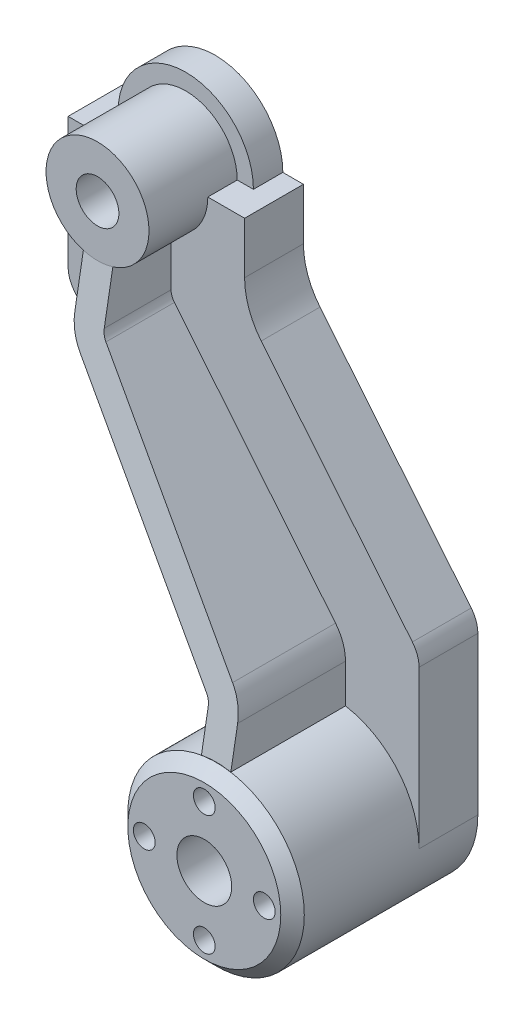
ISO-10303-21;
HEADER;
FILE_DESCRIPTION(('STEP AP214'),'2;1');
FILE_NAME('part.step','',(''),(''),'','','');
FILE_SCHEMA(('AUTOMOTIVE_DESIGN { 1 0 10303 214 1 1 1 1 }'));
ENDSEC;
DATA;
#1=APPLICATION_CONTEXT('core data for automotive mechanical design processes');
#2=APPLICATION_PROTOCOL_DEFINITION('international standard','automotive_design',2000,#1);
#3=PRODUCT_CONTEXT('',#1,'mechanical');
#4=PRODUCT('Part','Part','',(#3));
#5=PRODUCT_RELATED_PRODUCT_CATEGORY('part','',(#4));
#6=PRODUCT_DEFINITION_FORMATION('','',#4);
#7=PRODUCT_DEFINITION_CONTEXT('part definition',#1,'design');
#8=PRODUCT_DEFINITION('design','',#6,#7);
#9=PRODUCT_DEFINITION_SHAPE('','',#8);
#10=(LENGTH_UNIT() NAMED_UNIT(*) SI_UNIT(.MILLI.,.METRE.));
#11=(NAMED_UNIT(*) PLANE_ANGLE_UNIT() SI_UNIT($,.RADIAN.));
#12=(NAMED_UNIT(*) SI_UNIT($,.STERADIAN.) SOLID_ANGLE_UNIT());
#13=UNCERTAINTY_MEASURE_WITH_UNIT(LENGTH_MEASURE(1.E-05),#10,'distance_accuracy_value','');
#14=(GEOMETRIC_REPRESENTATION_CONTEXT(3) GLOBAL_UNCERTAINTY_ASSIGNED_CONTEXT((#13)) GLOBAL_UNIT_ASSIGNED_CONTEXT((#10,
#11,#12)) REPRESENTATION_CONTEXT('',''));
#15=CARTESIAN_POINT('',(0.,0.,0.));
#16=DIRECTION('',(0.,0.,1.));
#17=DIRECTION('',(1.,0.,0.));
#18=AXIS2_PLACEMENT_3D('',#15,#16,#17);
#19=CARTESIAN_POINT('',(-11.5,-17.5,29.9));
#20=DIRECTION('',(0.,0.172463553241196,0.985015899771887));
#21=DIRECTION('',(0.,-0.985015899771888,0.172463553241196));
#22=AXIS2_PLACEMENT_3D('',#19,#20,#21);
#23=PLANE('',#22);
#24=DIRECTION('',(0.,-0.985015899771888,0.172463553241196));
#25=VECTOR('',#24,1.);
#26=CARTESIAN_POINT('',(5.,-0.537502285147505,26.9300858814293));
#27=LINE('',#26,#25);
#28=CARTESIAN_POINT('',(5.,-16.7705098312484,29.7722756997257));
#29=VERTEX_POINT('',#28);
#30=CARTESIAN_POINT('',(5.,-33.5596999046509,32.711845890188));
#31=VERTEX_POINT('',#30);
#32=EDGE_CURVE('E361',#29,#31,#27,.T.);
#33=ORIENTED_EDGE('',*,*,#32,.F.);
#34=CARTESIAN_POINT('',(0.,0.,26.8359761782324));
#35=DIRECTION('',(0.,0.172463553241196,0.985015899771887));
#36=DIRECTION('',(0.,0.985015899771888,-0.172463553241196));
#37=AXIS2_PLACEMENT_3D('',#34,#35,#36);
#38=ELLIPSE('',#37,17.7662106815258,17.5);
#39=CARTESIAN_POINT('',(-5.,-16.7705098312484,29.7722756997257));
#40=VERTEX_POINT('',#39);
#41=EDGE_CURVE('E346',#29,#40,#38,.F.);
#42=ORIENTED_EDGE('',*,*,#41,.T.);
#43=DIRECTION('',(0.,-0.985015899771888,0.172463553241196));
#44=VECTOR('',#43,1.);
#45=CARTESIAN_POINT('',(-5.,-0.537502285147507,26.9300858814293));
#46=LINE('',#45,#44);
#47=CARTESIAN_POINT('',(-5.,-33.5596999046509,32.711845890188));
#48=VERTEX_POINT('',#47);
#49=EDGE_CURVE('E334',#40,#48,#46,.T.);
#50=ORIENTED_EDGE('',*,*,#49,.T.);
#51=CARTESIAN_POINT('',(10.,-33.5596999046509,32.711845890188));
#52=DIRECTION('',(0.,0.172463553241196,0.985015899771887));
#53=DIRECTION('',(0.,0.985015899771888,-0.172463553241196));
#54=AXIS2_PLACEMENT_3D('',#51,#52,#53);
#55=ELLIPSE('',#54,15.2281805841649,15.);
#56=CARTESIAN_POINT('',(-1.61521985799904,-43.0510995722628,34.3736673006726));
#57=VERTEX_POINT('',#56);
#58=EDGE_CURVE('E389',#48,#57,#55,.T.);
#59=ORIENTED_EDGE('',*,*,#58,.T.);
#60=DIRECTION('',(0.62702340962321,-0.767327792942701,0.134349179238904));
#61=VECTOR('',#60,1.);
#62=CARTESIAN_POINT('',(-1.98365794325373,-42.6002188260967,34.2947239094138));
#63=LINE('',#62,#61);
#64=CARTESIAN_POINT('',(53.1692719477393,-110.094311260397,46.1120671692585));
#65=VERTEX_POINT('',#64);
#66=EDGE_CURVE('E393',#57,#65,#63,.T.);
#67=ORIENTED_EDGE('',*,*,#66,.T.);
#68=CARTESIAN_POINT('',(49.2975319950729,-113.258111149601,46.66600763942));
#69=DIRECTION('',(0.,0.172463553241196,0.985015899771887));
#70=DIRECTION('',(0.,0.985015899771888,-0.172463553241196));
#71=AXIS2_PLACEMENT_3D('',#68,#69,#70);
#72=ELLIPSE('',#71,5.07606019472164,5.);
#73=CARTESIAN_POINT('',(54.2975319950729,-113.258111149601,46.66600763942));
#74=VERTEX_POINT('',#73);
#75=EDGE_CURVE('E397',#65,#74,#72,.F.);
#76=ORIENTED_EDGE('',*,*,#75,.T.);
#77=DIRECTION('',(0.,-0.985015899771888,0.172463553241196));
#78=VECTOR('',#77,1.);
#79=CARTESIAN_POINT('',(54.2975319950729,-110.426900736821,46.1702992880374));
#80=LINE('',#79,#78);
#81=CARTESIAN_POINT('',(54.2975319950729,-126.437034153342,48.9734667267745));
#82=VERTEX_POINT('',#81);
#83=EDGE_CURVE('E400',#74,#82,#80,.T.);
#84=ORIENTED_EDGE('',*,*,#83,.T.);
#85=CARTESIAN_POINT('',(59.2975319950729,-156.01743306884,54.1526122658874));
#86=DIRECTION('',(0.,0.172463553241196,0.985015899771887));
#87=DIRECTION('',(0.,-0.985015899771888,0.172463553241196));
#88=AXIS2_PLACEMENT_3D('',#85,#86,#87);
#89=ELLIPSE('',#88,30.4563611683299,30.);
#90=CARTESIAN_POINT('',(64.2975319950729,-126.437034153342,48.9734667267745));
#91=VERTEX_POINT('',#90);
#92=EDGE_CURVE('E433',#82,#91,#89,.F.);
#93=ORIENTED_EDGE('',*,*,#92,.T.);
#94=DIRECTION('',(0.,-0.985015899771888,0.172463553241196));
#95=VECTOR('',#94,1.);
#96=CARTESIAN_POINT('',(64.2975319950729,-110.426900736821,46.1702992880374));
#97=LINE('',#96,#95);
#98=CARTESIAN_POINT('',(64.2975319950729,-113.258111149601,46.66600763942));
#99=VERTEX_POINT('',#98);
#100=EDGE_CURVE('E357',#99,#91,#97,.T.);
#101=ORIENTED_EDGE('',*,*,#100,.F.);
#102=CARTESIAN_POINT('',(49.2975319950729,-113.258111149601,46.66600763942));
#103=DIRECTION('',(0.,0.172463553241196,0.985015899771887));
#104=DIRECTION('',(0.,0.985015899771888,-0.172463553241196));
#105=AXIS2_PLACEMENT_3D('',#102,#103,#104);
#106=ELLIPSE('',#105,15.2281805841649,15.);
#107=CARTESIAN_POINT('',(60.912751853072,-103.766711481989,45.0041862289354));
#108=VERTEX_POINT('',#107);
#109=EDGE_CURVE('E384',#108,#99,#106,.F.);
#110=ORIENTED_EDGE('',*,*,#109,.F.);
#111=DIRECTION('',(0.62702340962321,-0.767327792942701,0.134349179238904));
#112=VECTOR('',#111,1.);
#113=CARTESIAN_POINT('',(5.85314994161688,-36.3868303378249,33.2068398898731));
#114=LINE('',#113,#112);
#115=CARTESIAN_POINT('',(6.12826004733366,-36.7234997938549,33.2657863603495));
#116=VERTEX_POINT('',#115);
#117=EDGE_CURVE('E380',#116,#108,#114,.T.);
#118=ORIENTED_EDGE('',*,*,#117,.F.);
#119=CARTESIAN_POINT('',(10.,-33.5596999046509,32.711845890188));
#120=DIRECTION('',(0.,0.172463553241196,0.985015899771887));
#121=DIRECTION('',(0.,0.985015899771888,-0.172463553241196));
#122=AXIS2_PLACEMENT_3D('',#119,#120,#121);
#123=ELLIPSE('',#122,5.07606019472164,4.99999999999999);
#124=EDGE_CURVE('E376',#31,#116,#123,.T.);
#125=ORIENTED_EDGE('',*,*,#124,.F.);
#126=EDGE_LOOP('',(#33,#42,#50,#59,#67,#76,#84,#93,#101,#110,#118,#125));
#127=FACE_BOUND('',#126,.T.);
#128=ADVANCED_FACE('F102',(#127),#23,.T.);
#129=CARTESIAN_POINT('',(31.4072868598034,-270.899429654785,10.));
#130=DIRECTION('',(0.,0.,1.));
#131=DIRECTION('',(1.,0.,0.));
#132=AXIS2_PLACEMENT_3D('',#129,#130,#131);
#133=PLANE('',#132);
#134=DIRECTION('',(0.,-1.,0.));
#135=VECTOR('',#134,1.);
#136=CARTESIAN_POINT('',(-30.,0.,10.));
#137=LINE('',#136,#135);
#138=CARTESIAN_POINT('',(-30.,0.,10.));
#139=VERTEX_POINT('',#138);
#140=CARTESIAN_POINT('',(-30.,-44.2581646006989,10.));
#141=VERTEX_POINT('',#140);
#142=EDGE_CURVE('E546',#139,#141,#137,.T.);
#143=ORIENTED_EDGE('',*,*,#142,.T.);
#144=CARTESIAN_POINT('',(-20.,-44.2581646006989,10.));
#145=DIRECTION('',(0.,0.,1.));
#146=DIRECTION('',(1.,0.,0.));
#147=AXIS2_PLACEMENT_3D('',#144,#145,#146);
#148=CIRCLE('',#147,10.);
#149=CARTESIAN_POINT('',(-27.7434799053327,-50.5857643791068,10.));
#150=VERTEX_POINT('',#149);
#151=EDGE_CURVE('E618',#141,#150,#148,.T.);
#152=ORIENTED_EDGE('',*,*,#151,.T.);
#153=DIRECTION('',(0.632759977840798,-0.77434799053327,0.));
#154=VECTOR('',#153,1.);
#155=CARTESIAN_POINT('',(-30.,-47.8243194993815,10.));
#156=LINE('',#155,#154);
#157=CARTESIAN_POINT('',(23.6562317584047,-113.486808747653,10.));
#158=VERTEX_POINT('',#157);
#159=EDGE_CURVE('E543',#150,#158,#156,.T.);
#160=ORIENTED_EDGE('',*,*,#159,.T.);
#161=CARTESIAN_POINT('',(4.29753199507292,-129.305808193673,10.));
#162=DIRECTION('',(0.,0.,1.));
#163=DIRECTION('',(1.,0.,0.));
#164=AXIS2_PLACEMENT_3D('',#161,#162,#163);
#165=CIRCLE('',#164,25.);
#166=CARTESIAN_POINT('',(29.2975319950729,-129.305808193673,10.));
#167=VERTEX_POINT('',#166);
#168=EDGE_CURVE('E54',#158,#167,#165,.F.);
#169=ORIENTED_EDGE('',*,*,#168,.T.);
#170=DIRECTION('',(0.,-1.,0.));
#171=VECTOR('',#170,1.);
#172=CARTESIAN_POINT('',(29.2975319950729,-120.390420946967,10.));
#173=LINE('',#172,#171);
#174=CARTESIAN_POINT('',(29.2975319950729,-156.01743306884,10.));
#175=VERTEX_POINT('',#174);
#176=EDGE_CURVE('E541',#167,#175,#173,.T.);
#177=ORIENTED_EDGE('',*,*,#176,.T.);
#178=CARTESIAN_POINT('',(59.2975319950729,-156.01743306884,10.));
#179=DIRECTION('',(0.,0.,1.));
#180=DIRECTION('',(1.,0.,0.));
#181=AXIS2_PLACEMENT_3D('',#178,#179,#180);
#182=CIRCLE('',#181,30.);
#183=CARTESIAN_POINT('',(54.2975319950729,-126.437034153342,10.));
#184=VERTEX_POINT('',#183);
#185=EDGE_CURVE('E510',#184,#175,#182,.T.);
#186=ORIENTED_EDGE('',*,*,#185,.F.);
#187=DIRECTION('',(0.,1.,0.));
#188=VECTOR('',#187,1.);
#189=CARTESIAN_POINT('',(54.2975319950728,-270.899429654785,10.));
#190=LINE('',#189,#188);
#191=CARTESIAN_POINT('',(54.2975319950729,-113.258111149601,10.));
#192=VERTEX_POINT('',#191);
#193=EDGE_CURVE('E411',#184,#192,#190,.T.);
#194=ORIENTED_EDGE('',*,*,#193,.T.);
#195=CARTESIAN_POINT('',(49.2975319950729,-113.258111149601,10.));
#196=DIRECTION('',(0.,0.,1.));
#197=DIRECTION('',(1.,0.,0.));
#198=AXIS2_PLACEMENT_3D('',#195,#196,#197);
#199=CIRCLE('',#198,5.);
#200=CARTESIAN_POINT('',(53.1692719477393,-110.094311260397,10.));
#201=VERTEX_POINT('',#200);
#202=EDGE_CURVE('E407',#192,#201,#199,.T.);
#203=ORIENTED_EDGE('',*,*,#202,.T.);
#204=DIRECTION('',(-0.632759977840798,0.77434799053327,0.));
#205=VECTOR('',#204,1.);
#206=CARTESIAN_POINT('',(123.246811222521,-195.852582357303,10.));
#207=LINE('',#206,#205);
#208=CARTESIAN_POINT('',(-1.61521985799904,-43.0510995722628,10.));
#209=VERTEX_POINT('',#208);
#210=EDGE_CURVE('E405',#201,#209,#207,.T.);
#211=ORIENTED_EDGE('',*,*,#210,.T.);
#212=CARTESIAN_POINT('',(10.,-33.5596999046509,10.));
#213=DIRECTION('',(0.,0.,1.));
#214=DIRECTION('',(1.,0.,0.));
#215=AXIS2_PLACEMENT_3D('',#212,#213,#214);
#216=CIRCLE('',#215,15.);
#217=CARTESIAN_POINT('',(-4.99999999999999,-33.5596999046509,10.));
#218=VERTEX_POINT('',#217);
#219=EDGE_CURVE('E403',#209,#218,#216,.F.);
#220=ORIENTED_EDGE('',*,*,#219,.T.);
#221=DIRECTION('',(0.,1.,0.));
#222=VECTOR('',#221,1.);
#223=CARTESIAN_POINT('',(-4.99999999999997,-270.899429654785,10.));
#224=LINE('',#223,#222);
#225=CARTESIAN_POINT('',(-5.,-16.7705098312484,10.));
#226=VERTEX_POINT('',#225);
#227=EDGE_CURVE('E356',#218,#226,#224,.T.);
#228=ORIENTED_EDGE('',*,*,#227,.T.);
#229=CARTESIAN_POINT('',(0.,0.,10.));
#230=DIRECTION('',(0.,0.,1.));
#231=DIRECTION('',(1.,0.,0.));
#232=AXIS2_PLACEMENT_3D('',#229,#230,#231);
#233=CIRCLE('',#232,17.5);
#234=CARTESIAN_POINT('',(-17.5,0.,10.));
#235=VERTEX_POINT('',#234);
#236=EDGE_CURVE('E353',#226,#235,#233,.F.);
#237=ORIENTED_EDGE('',*,*,#236,.T.);
#238=DIRECTION('',(1.,0.,0.));
#239=VECTOR('',#238,1.);
#240=CARTESIAN_POINT('',(-30.,0.,10.));
#241=LINE('',#240,#239);
#242=EDGE_CURVE('E550',#139,#235,#241,.T.);
#243=ORIENTED_EDGE('',*,*,#242,.F.);
#244=EDGE_LOOP('',(#143,#152,#160,#169,#177,#186,#194,#203,#211,#220,#228,#237,#243));
#245=FACE_BOUND('',#244,.T.);
#246=ADVANCED_FACE('F639',(#245),#133,.T.);
#247=CARTESIAN_POINT('',(31.4072868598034,-270.899429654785,-10.));
#248=DIRECTION('',(0.,0.,1.));
#249=DIRECTION('',(1.,0.,0.));
#250=AXIS2_PLACEMENT_3D('',#247,#248,#249);
#251=PLANE('',#250);
#252=CARTESIAN_POINT('',(59.2975319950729,-156.01743306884,-10.));
#253=DIRECTION('',(0.,0.,-1.));
#254=DIRECTION('',(-1.,0.,0.));
#255=AXIS2_PLACEMENT_3D('',#252,#253,#254);
#256=CIRCLE('',#255,18.1546949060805);
#257=CARTESIAN_POINT('',(41.1428370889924,-156.01743306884,-10.));
#258=VERTEX_POINT('',#257);
#259=EDGE_CURVE('E1264',#258,#258,#256,.T.);
#260=ORIENTED_EDGE('',*,*,#259,.F.);
#261=EDGE_LOOP('',(#260));
#262=FACE_BOUND('',#261,.T.);
#263=CARTESIAN_POINT('',(0.,0.,-10.));
#264=DIRECTION('',(0.,0.,-1.));
#265=DIRECTION('',(-1.,0.,0.));
#266=AXIS2_PLACEMENT_3D('',#263,#264,#265);
#267=CIRCLE('',#266,13.8600862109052);
#268=CARTESIAN_POINT('',(-13.8600862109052,0.,-10.));
#269=VERTEX_POINT('',#268);
#270=EDGE_CURVE('E1279',#269,#269,#267,.T.);
#271=ORIENTED_EDGE('',*,*,#270,.F.);
#272=EDGE_LOOP('',(#271));
#273=FACE_BOUND('',#272,.T.);
#274=CARTESIAN_POINT('',(59.2975319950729,-156.01743306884,-10.));
#275=DIRECTION('',(0.,0.,-1.));
#276=DIRECTION('',(-1.,0.,0.));
#277=AXIS2_PLACEMENT_3D('',#274,#275,#276);
#278=CIRCLE('',#277,30.);
#279=CARTESIAN_POINT('',(39.2975319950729,-133.656753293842,-10.));
#280=VERTEX_POINT('',#279);
#281=CARTESIAN_POINT('',(79.2975319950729,-133.656753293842,-10.));
#282=VERTEX_POINT('',#281);
#283=EDGE_CURVE('E455',#280,#282,#278,.T.);
#284=ORIENTED_EDGE('',*,*,#283,.T.);
#285=DIRECTION('',(0.,-1.,0.));
#286=VECTOR('',#285,1.);
#287=CARTESIAN_POINT('',(79.2975319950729,-89.5973357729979,-10.));
#288=LINE('',#287,#286);
#289=CARTESIAN_POINT('',(79.2975319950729,-102.559646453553,-10.));
#290=VERTEX_POINT('',#289);
#291=EDGE_CURVE('E437',#290,#282,#288,.T.);
#292=ORIENTED_EDGE('',*,*,#291,.F.);
#293=DIRECTION('',(0.632759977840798,-0.77434799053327,0.));
#294=VECTOR('',#293,1.);
#295=CARTESIAN_POINT('',(-32.8200447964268,34.6456499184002,-10.));
#296=LINE('',#295,#294);
#297=CARTESIAN_POINT('',(20.,-29.9935450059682,-10.));
#298=VERTEX_POINT('',#297);
#299=EDGE_CURVE('E468',#298,#290,#296,.T.);
#300=ORIENTED_EDGE('',*,*,#299,.F.);
#301=DIRECTION('',(-1.,0.,0.));
#302=VECTOR('',#301,1.);
#303=CARTESIAN_POINT('',(-184.863962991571,-29.9935450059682,-10.));
#304=LINE('',#303,#302);
#305=CARTESIAN_POINT('',(-20.,-29.9935450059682,-10.));
#306=VERTEX_POINT('',#305);
#307=EDGE_CURVE('E466',#298,#306,#304,.T.);
#308=ORIENTED_EDGE('',*,*,#307,.T.);
#309=DIRECTION('',(0.,1.,0.));
#310=VECTOR('',#309,1.);
#311=CARTESIAN_POINT('',(-20.,-89.5973357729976,-10.));
#312=LINE('',#311,#310);
#313=CARTESIAN_POINT('',(-20.,-44.2581646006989,-10.));
#314=VERTEX_POINT('',#313);
#315=EDGE_CURVE('E463',#314,#306,#312,.T.);
#316=ORIENTED_EDGE('',*,*,#315,.F.);
#317=DIRECTION('',(-0.632759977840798,0.77434799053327,0.));
#318=VECTOR('',#317,1.);
#319=CARTESIAN_POINT('',(-63.7939644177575,9.33525080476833,-10.));
#320=LINE('',#319,#318);
#321=CARTESIAN_POINT('',(39.2975319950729,-116.824266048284,-10.));
#322=VERTEX_POINT('',#321);
#323=EDGE_CURVE('E460',#322,#314,#320,.T.);
#324=ORIENTED_EDGE('',*,*,#323,.F.);
#325=DIRECTION('',(0.,1.,0.));
#326=VECTOR('',#325,1.);
#327=CARTESIAN_POINT('',(39.297531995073,-89.597335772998,-10.));
#328=LINE('',#327,#326);
#329=EDGE_CURVE('E457',#280,#322,#328,.T.);
#330=ORIENTED_EDGE('',*,*,#329,.F.);
#331=EDGE_LOOP('',(#284,#292,#300,#308,#316,#324,#330));
#332=FACE_BOUND('',#331,.T.);
#333=DIRECTION('',(0.632759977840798,-0.77434799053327,0.));
#334=VECTOR('',#333,1.);
#335=CARTESIAN_POINT('',(30.,-26.4273901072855,-10.));
#336=LINE('',#335,#334);
#337=CARTESIAN_POINT('',(35.6413002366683,-33.3310023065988,-10.));
#338=VERTEX_POINT('',#337);
#339=CARTESIAN_POINT('',(87.0410119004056,-96.2320466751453,-10.));
#340=VERTEX_POINT('',#339);
#341=EDGE_CURVE('E517',#338,#340,#336,.T.);
#342=ORIENTED_EDGE('',*,*,#341,.T.);
#343=CARTESIAN_POINT('',(79.2975319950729,-102.559646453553,-10.));
#344=DIRECTION('',(0.,0.,1.));
#345=DIRECTION('',(1.,0.,0.));
#346=AXIS2_PLACEMENT_3D('',#343,#344,#345);
#347=CIRCLE('',#346,10.);
#348=CARTESIAN_POINT('',(89.2975319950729,-102.559646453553,-10.));
#349=VERTEX_POINT('',#348);
#350=EDGE_CURVE('E612',#340,#349,#347,.F.);
#351=ORIENTED_EDGE('',*,*,#350,.T.);
#352=DIRECTION('',(0.,-1.,0.));
#353=VECTOR('',#352,1.);
#354=CARTESIAN_POINT('',(89.2975319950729,-98.9934915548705,-10.));
#355=LINE('',#354,#353);
#356=CARTESIAN_POINT('',(89.2975319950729,-156.01743306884,-10.));
#357=VERTEX_POINT('',#356);
#358=EDGE_CURVE('E520',#349,#357,#355,.T.);
#359=ORIENTED_EDGE('',*,*,#358,.T.);
#360=CARTESIAN_POINT('',(59.2975319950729,-156.01743306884,-10.));
#361=DIRECTION('',(0.,0.,1.));
#362=DIRECTION('',(1.,0.,0.));
#363=AXIS2_PLACEMENT_3D('',#360,#361,#362);
#364=CIRCLE('',#363,30.);
#365=CARTESIAN_POINT('',(29.2975319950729,-156.01743306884,-10.));
#366=VERTEX_POINT('',#365);
#367=EDGE_CURVE('E558',#366,#357,#364,.T.);
#368=ORIENTED_EDGE('',*,*,#367,.F.);
#369=DIRECTION('',(0.,-1.,0.));
#370=VECTOR('',#369,1.);
#371=CARTESIAN_POINT('',(29.2975319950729,-120.390420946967,-10.));
#372=LINE('',#371,#370);
#373=CARTESIAN_POINT('',(29.2975319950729,-129.305808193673,-10.));
#374=VERTEX_POINT('',#373);
#375=EDGE_CURVE('E522',#374,#366,#372,.T.);
#376=ORIENTED_EDGE('',*,*,#375,.F.);
#377=CARTESIAN_POINT('',(4.29753199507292,-129.305808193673,-10.));
#378=DIRECTION('',(0.,0.,1.));
#379=DIRECTION('',(1.,0.,0.));
#380=AXIS2_PLACEMENT_3D('',#377,#378,#379);
#381=CIRCLE('',#380,25.);
#382=CARTESIAN_POINT('',(23.6562317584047,-113.486808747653,-10.));
#383=VERTEX_POINT('',#382);
#384=EDGE_CURVE('E110',#374,#383,#381,.T.);
#385=ORIENTED_EDGE('',*,*,#384,.T.);
#386=DIRECTION('',(0.632759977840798,-0.77434799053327,0.));
#387=VECTOR('',#386,1.);
#388=CARTESIAN_POINT('',(-30.,-47.8243194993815,-10.));
#389=LINE('',#388,#387);
#390=CARTESIAN_POINT('',(-27.7434799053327,-50.5857643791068,-10.));
#391=VERTEX_POINT('',#390);
#392=EDGE_CURVE('E524',#391,#383,#389,.T.);
#393=ORIENTED_EDGE('',*,*,#392,.F.);
#394=CARTESIAN_POINT('',(-20.,-44.2581646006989,-10.));
#395=DIRECTION('',(0.,0.,1.));
#396=DIRECTION('',(1.,0.,0.));
#397=AXIS2_PLACEMENT_3D('',#394,#395,#396);
#398=CIRCLE('',#397,10.);
#399=CARTESIAN_POINT('',(-30.,-44.2581646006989,-10.));
#400=VERTEX_POINT('',#399);
#401=EDGE_CURVE('E610',#391,#400,#398,.F.);
#402=ORIENTED_EDGE('',*,*,#401,.T.);
#403=DIRECTION('',(0.,-1.,0.));
#404=VECTOR('',#403,1.);
#405=CARTESIAN_POINT('',(-30.,0.,-10.));
#406=LINE('',#405,#404);
#407=CARTESIAN_POINT('',(-30.,0.,-10.));
#408=VERTEX_POINT('',#407);
#409=EDGE_CURVE('E527',#408,#400,#406,.T.);
#410=ORIENTED_EDGE('',*,*,#409,.F.);
#411=DIRECTION('',(1.,0.,0.));
#412=VECTOR('',#411,1.);
#413=CARTESIAN_POINT('',(-30.,0.,-10.));
#414=LINE('',#413,#412);
#415=CARTESIAN_POINT('',(-23.,0.,-9.99999999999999));
#416=VERTEX_POINT('',#415);
#417=EDGE_CURVE('E530',#408,#416,#414,.T.);
#418=ORIENTED_EDGE('',*,*,#417,.T.);
#419=CARTESIAN_POINT('',(0.,0.,-9.99999999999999));
#420=DIRECTION('',(0.,0.,1.));
#421=DIRECTION('',(1.,0.,0.));
#422=AXIS2_PLACEMENT_3D('',#419,#420,#421);
#423=CIRCLE('',#422,23.);
#424=CARTESIAN_POINT('',(23.,0.,-9.99999999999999));
#425=VERTEX_POINT('',#424);
#426=EDGE_CURVE('E502',#416,#425,#423,.F.);
#427=ORIENTED_EDGE('',*,*,#426,.T.);
#428=CARTESIAN_POINT('',(30.,0.,-10.));
#429=VERTEX_POINT('',#428);
#430=EDGE_CURVE('E529',#425,#429,#414,.T.);
#431=ORIENTED_EDGE('',*,*,#430,.T.);
#432=DIRECTION('',(0.,-1.,0.));
#433=VECTOR('',#432,1.);
#434=CARTESIAN_POINT('',(30.,0.,-10.));
#435=LINE('',#434,#433);
#436=CARTESIAN_POINT('',(30.,-17.5120028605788,-10.));
#437=VERTEX_POINT('',#436);
#438=EDGE_CURVE('E514',#429,#437,#435,.T.);
#439=ORIENTED_EDGE('',*,*,#438,.T.);
#440=CARTESIAN_POINT('',(55.,-17.5120028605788,-10.));
#441=DIRECTION('',(0.,0.,1.));
#442=DIRECTION('',(1.,0.,0.));
#443=AXIS2_PLACEMENT_3D('',#440,#441,#442);
#444=CIRCLE('',#443,25.);
#445=EDGE_CURVE('E620',#437,#338,#444,.T.);
#446=ORIENTED_EDGE('',*,*,#445,.T.);
#447=EDGE_LOOP('',(#342,#351,#359,#368,#376,#385,#393,#402,#410,#418,#427,#431,#439,#446));
#448=FACE_BOUND('',#447,.T.);
#449=ADVANCED_FACE('F626',(#262,#273,#332,#448),#251,.F.);
#450=DIRECTION('',(0.,-1.,0.));
#451=VECTOR('',#450,1.);
#452=CARTESIAN_POINT('',(89.2975319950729,-98.9934915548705,10.));
#453=LINE('',#452,#451);
#454=CARTESIAN_POINT('',(89.2975319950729,-102.559646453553,10.));
#455=VERTEX_POINT('',#454);
#456=CARTESIAN_POINT('',(89.2975319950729,-156.01743306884,10.));
#457=VERTEX_POINT('',#456);
#458=EDGE_CURVE('E539',#455,#457,#453,.T.);
#459=ORIENTED_EDGE('',*,*,#458,.F.);
#460=CARTESIAN_POINT('',(79.2975319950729,-102.559646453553,10.));
#461=DIRECTION('',(0.,0.,1.));
#462=DIRECTION('',(1.,0.,0.));
#463=AXIS2_PLACEMENT_3D('',#460,#461,#462);
#464=CIRCLE('',#463,10.);
#465=CARTESIAN_POINT('',(87.0410119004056,-96.2320466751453,10.));
#466=VERTEX_POINT('',#465);
#467=EDGE_CURVE('E615',#455,#466,#464,.T.);
#468=ORIENTED_EDGE('',*,*,#467,.T.);
#469=DIRECTION('',(0.632759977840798,-0.77434799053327,0.));
#470=VECTOR('',#469,1.);
#471=CARTESIAN_POINT('',(30.,-26.4273901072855,10.));
#472=LINE('',#471,#470);
#473=CARTESIAN_POINT('',(35.6413002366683,-33.3310023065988,10.));
#474=VERTEX_POINT('',#473);
#475=EDGE_CURVE('E536',#474,#466,#472,.T.);
#476=ORIENTED_EDGE('',*,*,#475,.F.);
#477=CARTESIAN_POINT('',(55.,-17.5120028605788,10.));
#478=DIRECTION('',(0.,0.,1.));
#479=DIRECTION('',(1.,0.,0.));
#480=AXIS2_PLACEMENT_3D('',#477,#478,#479);
#481=CIRCLE('',#480,25.);
#482=CARTESIAN_POINT('',(30.,-17.5120028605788,10.));
#483=VERTEX_POINT('',#482);
#484=EDGE_CURVE('E622',#474,#483,#481,.F.);
#485=ORIENTED_EDGE('',*,*,#484,.T.);
#486=DIRECTION('',(0.,-1.,0.));
#487=VECTOR('',#486,1.);
#488=CARTESIAN_POINT('',(30.,0.,10.));
#489=LINE('',#488,#487);
#490=CARTESIAN_POINT('',(30.,0.,10.));
#491=VERTEX_POINT('',#490);
#492=EDGE_CURVE('E533',#491,#483,#489,.T.);
#493=ORIENTED_EDGE('',*,*,#492,.F.);
#494=CARTESIAN_POINT('',(17.5,0.,10.));
#495=VERTEX_POINT('',#494);
#496=EDGE_CURVE('E549',#495,#491,#241,.T.);
#497=ORIENTED_EDGE('',*,*,#496,.F.);
#498=CARTESIAN_POINT('',(5.,-16.7705098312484,10.));
#499=VERTEX_POINT('',#498);
#500=EDGE_CURVE('E494',#495,#499,#233,.F.);
#501=ORIENTED_EDGE('',*,*,#500,.T.);
#502=DIRECTION('',(0.,1.,0.));
#503=VECTOR('',#502,1.);
#504=CARTESIAN_POINT('',(5.00000000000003,-270.899429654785,10.));
#505=LINE('',#504,#503);
#506=CARTESIAN_POINT('',(5.,-33.5596999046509,10.));
#507=VERTEX_POINT('',#506);
#508=EDGE_CURVE('E415',#507,#499,#505,.T.);
#509=ORIENTED_EDGE('',*,*,#508,.F.);
#510=CARTESIAN_POINT('',(10.,-33.5596999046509,10.));
#511=DIRECTION('',(0.,0.,1.));
#512=DIRECTION('',(1.,0.,0.));
#513=AXIS2_PLACEMENT_3D('',#510,#511,#512);
#514=CIRCLE('',#513,4.99999999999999);
#515=CARTESIAN_POINT('',(6.12826004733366,-36.7234997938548,10.));
#516=VERTEX_POINT('',#515);
#517=EDGE_CURVE('E418',#516,#507,#514,.F.);
#518=ORIENTED_EDGE('',*,*,#517,.F.);
#519=DIRECTION('',(-0.632759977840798,0.77434799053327,0.));
#520=VECTOR('',#519,1.);
#521=CARTESIAN_POINT('',(130.990291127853,-189.524982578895,10.));
#522=LINE('',#521,#520);
#523=CARTESIAN_POINT('',(60.9127518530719,-103.766711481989,10.));
#524=VERTEX_POINT('',#523);
#525=EDGE_CURVE('E421',#524,#516,#522,.T.);
#526=ORIENTED_EDGE('',*,*,#525,.F.);
#527=CARTESIAN_POINT('',(49.2975319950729,-113.258111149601,10.));
#528=DIRECTION('',(0.,0.,1.));
#529=DIRECTION('',(1.,0.,0.));
#530=AXIS2_PLACEMENT_3D('',#527,#528,#529);
#531=CIRCLE('',#530,15.);
#532=CARTESIAN_POINT('',(64.2975319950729,-113.258111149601,10.));
#533=VERTEX_POINT('',#532);
#534=EDGE_CURVE('E424',#533,#524,#531,.T.);
#535=ORIENTED_EDGE('',*,*,#534,.F.);
#536=DIRECTION('',(0.,1.,0.));
#537=VECTOR('',#536,1.);
#538=CARTESIAN_POINT('',(64.2975319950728,-270.899429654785,10.));
#539=LINE('',#538,#537);
#540=CARTESIAN_POINT('',(64.2975319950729,-126.437034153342,10.));
#541=VERTEX_POINT('',#540);
#542=EDGE_CURVE('E430',#541,#533,#539,.T.);
#543=ORIENTED_EDGE('',*,*,#542,.F.);
#544=EDGE_CURVE('E511',#457,#541,#182,.T.);
#545=ORIENTED_EDGE('',*,*,#544,.F.);
#546=EDGE_LOOP('',(#459,#468,#476,#485,#493,#497,#501,#509,#518,#526,#535,#543,#545));
#547=FACE_BOUND('',#546,.T.);
#548=ADVANCED_FACE('F656',(#547),#133,.T.);
#549=CARTESIAN_POINT('',(-30.,0.,10.));
#550=DIRECTION('',(0.,1.,0.));
#551=DIRECTION('',(0.,0.,1.));
#552=AXIS2_PLACEMENT_3D('',#549,#550,#551);
#553=PLANE('',#552);
#554=DIRECTION('',(1.,0.,0.));
#555=VECTOR('',#554,1.);
#556=CARTESIAN_POINT('',(-30.,0.,0.));
#557=LINE('',#556,#555);
#558=CARTESIAN_POINT('',(17.5,0.,0.));
#559=VERTEX_POINT('',#558);
#560=CARTESIAN_POINT('',(23.,0.,0.));
#561=VERTEX_POINT('',#560);
#562=EDGE_CURVE('E567',#559,#561,#557,.T.);
#563=ORIENTED_EDGE('',*,*,#562,.F.);
#564=DIRECTION('',(0.,0.,-1.));
#565=VECTOR('',#564,1.);
#566=CARTESIAN_POINT('',(17.5,0.,30.));
#567=LINE('',#566,#565);
#568=EDGE_CURVE('E497',#559,#495,#567,.F.);
#569=ORIENTED_EDGE('',*,*,#568,.T.);
#570=ORIENTED_EDGE('',*,*,#496,.T.);
#571=DIRECTION('',(0.,0.,-1.));
#572=VECTOR('',#571,1.);
#573=CARTESIAN_POINT('',(30.,0.,10.));
#574=LINE('',#573,#572);
#575=EDGE_CURVE('E555',#491,#429,#574,.T.);
#576=ORIENTED_EDGE('',*,*,#575,.T.);
#577=ORIENTED_EDGE('',*,*,#430,.F.);
#578=DIRECTION('',(0.,0.,1.));
#579=VECTOR('',#578,1.);
#580=CARTESIAN_POINT('',(23.,0.,-75.0538238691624));
#581=LINE('',#580,#579);
#582=EDGE_CURVE('E504',#561,#425,#581,.F.);
#583=ORIENTED_EDGE('',*,*,#582,.F.);
#584=EDGE_LOOP('',(#563,#569,#570,#576,#577,#583));
#585=FACE_BOUND('',#584,.T.);
#586=ADVANCED_FACE('F675',(#585),#553,.T.);
#587=ORIENTED_EDGE('',*,*,#242,.T.);
#588=DIRECTION('',(0.,0.,-1.));
#589=VECTOR('',#588,1.);
#590=CARTESIAN_POINT('',(-17.5,0.,30.));
#591=LINE('',#590,#589);
#592=CARTESIAN_POINT('',(-17.5,0.,0.));
#593=VERTEX_POINT('',#592);
#594=EDGE_CURVE('E491',#235,#593,#591,.T.);
#595=ORIENTED_EDGE('',*,*,#594,.T.);
#596=CARTESIAN_POINT('',(-23.,0.,0.));
#597=VERTEX_POINT('',#596);
#598=EDGE_CURVE('E570',#597,#593,#557,.T.);
#599=ORIENTED_EDGE('',*,*,#598,.F.);
#600=DIRECTION('',(0.,0.,1.));
#601=VECTOR('',#600,1.);
#602=CARTESIAN_POINT('',(-23.,0.,-75.0538238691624));
#603=LINE('',#602,#601);
#604=EDGE_CURVE('E507',#416,#597,#603,.T.);
#605=ORIENTED_EDGE('',*,*,#604,.F.);
#606=ORIENTED_EDGE('',*,*,#417,.F.);
#607=DIRECTION('',(0.,0.,-1.));
#608=VECTOR('',#607,1.);
#609=CARTESIAN_POINT('',(-30.,0.,10.));
#610=LINE('',#609,#608);
#611=EDGE_CURVE('E554',#139,#408,#610,.T.);
#612=ORIENTED_EDGE('',*,*,#611,.F.);
#613=EDGE_LOOP('',(#587,#595,#599,#605,#606,#612));
#614=FACE_BOUND('',#613,.T.);
#615=ADVANCED_FACE('F749',(#614),#553,.T.);
#616=CARTESIAN_POINT('',(0.,0.,0.));
#617=DIRECTION('',(0.,0.,1.));
#618=DIRECTION('',(1.,0.,0.));
#619=AXIS2_PLACEMENT_3D('',#616,#617,#618);
#620=PLANE('',#619);
#621=ORIENTED_EDGE('',*,*,#598,.T.);
#622=CARTESIAN_POINT('',(0.,0.,0.));
#623=DIRECTION('',(0.,0.,1.));
#624=DIRECTION('',(1.,0.,0.));
#625=AXIS2_PLACEMENT_3D('',#622,#623,#624);
#626=CIRCLE('',#625,17.5);
#627=EDGE_CURVE('E476',#559,#593,#626,.T.);
#628=ORIENTED_EDGE('',*,*,#627,.F.);
#629=ORIENTED_EDGE('',*,*,#562,.T.);
#630=CARTESIAN_POINT('',(0.,0.,0.));
#631=DIRECTION('',(0.,0.,1.));
#632=DIRECTION('',(1.,0.,0.));
#633=AXIS2_PLACEMENT_3D('',#630,#631,#632);
#634=CIRCLE('',#633,23.);
#635=EDGE_CURVE('E500',#561,#597,#634,.T.);
#636=ORIENTED_EDGE('',*,*,#635,.T.);
#637=EDGE_LOOP('',(#621,#628,#629,#636));
#638=FACE_BOUND('',#637,.T.);
#639=ADVANCED_FACE('F756',(#638),#620,.T.);
#640=CARTESIAN_POINT('',(30.,0.,10.));
#641=DIRECTION('',(1.,0.,0.));
#642=DIRECTION('',(0.,1.,0.));
#643=AXIS2_PLACEMENT_3D('',#640,#641,#642);
#644=PLANE('',#643);
#645=ORIENTED_EDGE('',*,*,#492,.T.);
#646=DIRECTION('',(0.,0.,-1.));
#647=VECTOR('',#646,1.);
#648=CARTESIAN_POINT('',(30.,-17.5120028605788,-10.));
#649=LINE('',#648,#647);
#650=EDGE_CURVE('E579',#483,#437,#649,.T.);
#651=ORIENTED_EDGE('',*,*,#650,.T.);
#652=ORIENTED_EDGE('',*,*,#438,.F.);
#653=ORIENTED_EDGE('',*,*,#575,.F.);
#654=EDGE_LOOP('',(#645,#651,#652,#653));
#655=FACE_BOUND('',#654,.T.);
#656=ADVANCED_FACE('F670',(#655),#644,.T.);
#657=CARTESIAN_POINT('',(-30.,0.,10.));
#658=DIRECTION('',(1.,0.,0.));
#659=DIRECTION('',(0.,1.,0.));
#660=AXIS2_PLACEMENT_3D('',#657,#658,#659);
#661=PLANE('',#660);
#662=ORIENTED_EDGE('',*,*,#409,.T.);
#663=DIRECTION('',(0.,0.,-1.));
#664=VECTOR('',#663,1.);
#665=CARTESIAN_POINT('',(-30.,-44.2581646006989,10.));
#666=LINE('',#665,#664);
#667=EDGE_CURVE('E117',#400,#141,#666,.F.);
#668=ORIENTED_EDGE('',*,*,#667,.T.);
#669=ORIENTED_EDGE('',*,*,#142,.F.);
#670=ORIENTED_EDGE('',*,*,#611,.T.);
#671=EDGE_LOOP('',(#662,#668,#669,#670));
#672=FACE_BOUND('',#671,.T.);
#673=ADVANCED_FACE('F744',(#672),#661,.F.);
#674=CARTESIAN_POINT('',(-30.,-47.8243194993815,10.));
#675=DIRECTION('',(0.77434799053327,0.632759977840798,0.));
#676=DIRECTION('',(-0.632759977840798,0.77434799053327,0.));
#677=AXIS2_PLACEMENT_3D('',#674,#675,#676);
#678=PLANE('',#677);
#679=ORIENTED_EDGE('',*,*,#392,.T.);
#680=DIRECTION('',(0.,0.,-1.));
#681=VECTOR('',#680,1.);
#682=CARTESIAN_POINT('',(23.6562317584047,-113.486808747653,10.));
#683=LINE('',#682,#681);
#684=EDGE_CURVE('E608',#383,#158,#683,.F.);
#685=ORIENTED_EDGE('',*,*,#684,.T.);
#686=ORIENTED_EDGE('',*,*,#159,.F.);
#687=DIRECTION('',(0.,0.,-1.));
#688=VECTOR('',#687,1.);
#689=CARTESIAN_POINT('',(-27.7434799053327,-50.5857643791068,10.));
#690=LINE('',#689,#688);
#691=EDGE_CURVE('E605',#150,#391,#690,.T.);
#692=ORIENTED_EDGE('',*,*,#691,.T.);
#693=EDGE_LOOP('',(#679,#685,#686,#692));
#694=FACE_BOUND('',#693,.T.);
#695=ADVANCED_FACE('F632',(#694),#678,.F.);
#696=CARTESIAN_POINT('',(29.2975319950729,-120.390420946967,10.));
#697=DIRECTION('',(1.,0.,0.));
#698=DIRECTION('',(0.,1.,0.));
#699=AXIS2_PLACEMENT_3D('',#696,#697,#698);
#700=PLANE('',#699);
#701=ORIENTED_EDGE('',*,*,#176,.F.);
#702=DIRECTION('',(0.,0.,-1.));
#703=VECTOR('',#702,1.);
#704=CARTESIAN_POINT('',(29.2975319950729,-129.305808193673,-10.));
#705=LINE('',#704,#703);
#706=EDGE_CURVE('E602',#167,#374,#705,.T.);
#707=ORIENTED_EDGE('',*,*,#706,.T.);
#708=ORIENTED_EDGE('',*,*,#375,.T.);
#709=DIRECTION('',(0.,0.,1.));
#710=VECTOR('',#709,1.);
#711=CARTESIAN_POINT('',(29.2975319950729,-156.01743306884,-10.));
#712=LINE('',#711,#710);
#713=EDGE_CURVE('E563',#366,#175,#712,.T.);
#714=ORIENTED_EDGE('',*,*,#713,.T.);
#715=EDGE_LOOP('',(#701,#707,#708,#714));
#716=FACE_BOUND('',#715,.T.);
#717=ADVANCED_FACE('F643',(#716),#700,.F.);
#718=CARTESIAN_POINT('',(89.2975319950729,-98.9934915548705,10.));
#719=DIRECTION('',(1.,0.,0.));
#720=DIRECTION('',(0.,1.,0.));
#721=AXIS2_PLACEMENT_3D('',#718,#719,#720);
#722=PLANE('',#721);
#723=ORIENTED_EDGE('',*,*,#358,.F.);
#724=DIRECTION('',(0.,0.,-1.));
#725=VECTOR('',#724,1.);
#726=CARTESIAN_POINT('',(89.2975319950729,-102.559646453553,10.));
#727=LINE('',#726,#725);
#728=EDGE_CURVE('E125',#349,#455,#727,.F.);
#729=ORIENTED_EDGE('',*,*,#728,.T.);
#730=ORIENTED_EDGE('',*,*,#458,.T.);
#731=DIRECTION('',(0.,0.,1.));
#732=VECTOR('',#731,1.);
#733=CARTESIAN_POINT('',(89.2975319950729,-156.01743306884,-10.));
#734=LINE('',#733,#732);
#735=EDGE_CURVE('E564',#357,#457,#734,.T.);
#736=ORIENTED_EDGE('',*,*,#735,.F.);
#737=EDGE_LOOP('',(#723,#729,#730,#736));
#738=FACE_BOUND('',#737,.T.);
#739=ADVANCED_FACE('F649',(#738),#722,.T.);
#740=CARTESIAN_POINT('',(30.,-26.4273901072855,10.));
#741=DIRECTION('',(0.77434799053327,0.632759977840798,0.));
#742=DIRECTION('',(-0.632759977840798,0.77434799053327,0.));
#743=AXIS2_PLACEMENT_3D('',#740,#741,#742);
#744=PLANE('',#743);
#745=ORIENTED_EDGE('',*,*,#341,.F.);
#746=DIRECTION('',(0.,0.,-1.));
#747=VECTOR('',#746,1.);
#748=CARTESIAN_POINT('',(35.6413002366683,-33.3310023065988,10.));
#749=LINE('',#748,#747);
#750=EDGE_CURVE('E600',#338,#474,#749,.F.);
#751=ORIENTED_EDGE('',*,*,#750,.T.);
#752=ORIENTED_EDGE('',*,*,#475,.T.);
#753=DIRECTION('',(0.,0.,-1.));
#754=VECTOR('',#753,1.);
#755=CARTESIAN_POINT('',(87.0410119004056,-96.2320466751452,10.));
#756=LINE('',#755,#754);
#757=EDGE_CURVE('E597',#466,#340,#756,.T.);
#758=ORIENTED_EDGE('',*,*,#757,.T.);
#759=EDGE_LOOP('',(#745,#751,#752,#758));
#760=FACE_BOUND('',#759,.T.);
#761=ADVANCED_FACE('F661',(#760),#744,.T.);
#762=CARTESIAN_POINT('',(59.2975319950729,-156.01743306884,-10.));
#763=DIRECTION('',(0.,0.,1.));
#764=DIRECTION('',(1.,0.,0.));
#765=AXIS2_PLACEMENT_3D('',#762,#763,#764);
#766=CYLINDRICAL_SURFACE('',#765,30.);
#767=DIRECTION('',(0.,0.,1.));
#768=VECTOR('',#767,1.);
#769=CARTESIAN_POINT('',(64.2975319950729,-126.437034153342,-10.));
#770=LINE('',#769,#768);
#771=EDGE_CURVE('E427',#91,#541,#770,.F.);
#772=ORIENTED_EDGE('',*,*,#771,.F.);
#773=ORIENTED_EDGE('',*,*,#92,.F.);
#774=DIRECTION('',(0.,0.,1.));
#775=VECTOR('',#774,1.);
#776=CARTESIAN_POINT('',(54.2975319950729,-126.437034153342,-10.));
#777=LINE('',#776,#775);
#778=EDGE_CURVE('E409',#82,#184,#777,.F.);
#779=ORIENTED_EDGE('',*,*,#778,.T.);
#780=ORIENTED_EDGE('',*,*,#185,.T.);
#781=ORIENTED_EDGE('',*,*,#713,.F.);
#782=ORIENTED_EDGE('',*,*,#367,.T.);
#783=ORIENTED_EDGE('',*,*,#735,.T.);
#784=ORIENTED_EDGE('',*,*,#544,.T.);
#785=EDGE_LOOP('',(#772,#773,#779,#780,#781,#782,#783,#784));
#786=FACE_BOUND('',#785,.T.);
#787=CARTESIAN_POINT('',(59.2975319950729,-156.01743306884,49.));
#788=DIRECTION('',(0.,0.,1.));
#789=DIRECTION('',(1.,0.,0.));
#790=AXIS2_PLACEMENT_3D('',#787,#788,#789);
#791=CIRCLE('',#790,30.);
#792=CARTESIAN_POINT('',(89.2975319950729,-156.01743306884,49.));
#793=VERTEX_POINT('',#792);
#794=EDGE_CURVE('E576',#793,#793,#791,.F.);
#795=ORIENTED_EDGE('',*,*,#794,.T.);
#796=EDGE_LOOP('',(#795));
#797=FACE_BOUND('',#796,.T.);
#798=ADVANCED_FACE('F646',(#786,#797),#766,.T.);
#799=CARTESIAN_POINT('',(59.2975319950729,-156.01743306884,53.));
#800=DIRECTION('',(0.,0.,1.));
#801=DIRECTION('',(1.,0.,0.));
#802=AXIS2_PLACEMENT_3D('',#799,#800,#801);
#803=PLANE('',#802);
#804=CARTESIAN_POINT('',(59.2975319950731,-176.417880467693,53.));
#805=DIRECTION('',(0.,0.,1.));
#806=DIRECTION('',(0.,-1.,0.));
#807=AXIS2_PLACEMENT_3D('',#804,#805,#806);
#808=CIRCLE('',#807,3.70338861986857);
#809=CARTESIAN_POINT('',(59.2975319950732,-180.121269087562,53.));
#810=VERTEX_POINT('',#809);
#811=EDGE_CURVE('E1238',#810,#810,#808,.T.);
#812=ORIENTED_EDGE('',*,*,#811,.F.);
#813=EDGE_LOOP('',(#812));
#814=FACE_BOUND('',#813,.T.);
#815=CARTESIAN_POINT('',(38.8970845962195,-156.01743306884,53.));
#816=DIRECTION('',(0.,0.,1.));
#817=DIRECTION('',(-1.,0.,0.));
#818=AXIS2_PLACEMENT_3D('',#815,#816,#817);
#819=CIRCLE('',#818,3.70338861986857);
#820=CARTESIAN_POINT('',(35.1936959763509,-156.01743306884,53.));
#821=VERTEX_POINT('',#820);
#822=EDGE_CURVE('E1237',#821,#821,#819,.T.);
#823=ORIENTED_EDGE('',*,*,#822,.F.);
#824=EDGE_LOOP('',(#823));
#825=FACE_BOUND('',#824,.T.);
#826=CARTESIAN_POINT('',(59.2975319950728,-135.616985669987,53.));
#827=DIRECTION('',(0.,0.,1.));
#828=DIRECTION('',(0.,1.,0.));
#829=AXIS2_PLACEMENT_3D('',#826,#827,#828);
#830=CIRCLE('',#829,3.70338861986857);
#831=CARTESIAN_POINT('',(59.2975319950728,-131.913597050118,53.));
#832=VERTEX_POINT('',#831);
#833=EDGE_CURVE('E1247',#832,#832,#830,.T.);
#834=ORIENTED_EDGE('',*,*,#833,.F.);
#835=EDGE_LOOP('',(#834));
#836=FACE_BOUND('',#835,.T.);
#837=CARTESIAN_POINT('',(79.6979793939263,-156.01743306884,53.));
#838=DIRECTION('',(0.,0.,1.));
#839=DIRECTION('',(1.,0.,0.));
#840=AXIS2_PLACEMENT_3D('',#837,#838,#839);
#841=CIRCLE('',#840,3.70338861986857);
#842=CARTESIAN_POINT('',(83.4013680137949,-156.01743306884,53.));
#843=VERTEX_POINT('',#842);
#844=EDGE_CURVE('E1252',#843,#843,#841,.T.);
#845=ORIENTED_EDGE('',*,*,#844,.F.);
#846=EDGE_LOOP('',(#845));
#847=FACE_BOUND('',#846,.T.);
#848=CARTESIAN_POINT('',(59.2975319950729,-156.01743306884,53.));
#849=DIRECTION('',(0.,0.,-1.));
#850=DIRECTION('',(-1.,0.,0.));
#851=AXIS2_PLACEMENT_3D('',#848,#849,#850);
#852=CIRCLE('',#851,9.31686810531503);
#853=CARTESIAN_POINT('',(49.9806638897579,-156.01743306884,53.));
#854=VERTEX_POINT('',#853);
#855=EDGE_CURVE('E1261',#854,#854,#852,.T.);
#856=ORIENTED_EDGE('',*,*,#855,.T.);
#857=EDGE_LOOP('',(#856));
#858=FACE_BOUND('',#857,.T.);
#859=CARTESIAN_POINT('',(59.2975319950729,-156.01743306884,53.));
#860=DIRECTION('',(0.,0.,1.));
#861=DIRECTION('',(1.,0.,0.));
#862=AXIS2_PLACEMENT_3D('',#859,#860,#861);
#863=CIRCLE('',#862,26.);
#864=CARTESIAN_POINT('',(85.2975319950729,-156.01743306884,53.));
#865=VERTEX_POINT('',#864);
#866=EDGE_CURVE('E573',#865,#865,#863,.T.);
#867=ORIENTED_EDGE('',*,*,#866,.T.);
#868=EDGE_LOOP('',(#867));
#869=FACE_BOUND('',#868,.T.);
#870=ADVANCED_FACE('F770',(#814,#825,#836,#847,#858,#869),#803,.T.);
#871=CARTESIAN_POINT('',(0.,0.,-75.0538238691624));
#872=DIRECTION('',(0.,0.,1.));
#873=DIRECTION('',(1.,0.,0.));
#874=AXIS2_PLACEMENT_3D('',#871,#872,#873);
#875=CYLINDRICAL_SURFACE('',#874,23.);
#876=ORIENTED_EDGE('',*,*,#604,.T.);
#877=ORIENTED_EDGE('',*,*,#635,.F.);
#878=ORIENTED_EDGE('',*,*,#582,.T.);
#879=ORIENTED_EDGE('',*,*,#426,.F.);
#880=EDGE_LOOP('',(#876,#877,#878,#879));
#881=FACE_BOUND('',#880,.T.);
#882=ADVANCED_FACE('F753',(#881),#875,.T.);
#883=CARTESIAN_POINT('',(0.,0.,30.));
#884=DIRECTION('',(0.,0.,-1.));
#885=DIRECTION('',(-1.,0.,0.));
#886=AXIS2_PLACEMENT_3D('',#883,#884,#885);
#887=CYLINDRICAL_SURFACE('',#886,17.5);
#888=DIRECTION('',(0.,0.,-1.));
#889=VECTOR('',#888,1.);
#890=CARTESIAN_POINT('',(-5.,-16.7705098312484,30.));
#891=LINE('',#890,#889);
#892=EDGE_CURVE('E338',#40,#226,#891,.T.);
#893=ORIENTED_EDGE('',*,*,#892,.F.);
#894=ORIENTED_EDGE('',*,*,#41,.F.);
#895=DIRECTION('',(0.,0.,-1.));
#896=VECTOR('',#895,1.);
#897=CARTESIAN_POINT('',(5.,-16.7705098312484,30.));
#898=LINE('',#897,#896);
#899=EDGE_CURVE('E413',#29,#499,#898,.T.);
#900=ORIENTED_EDGE('',*,*,#899,.T.);
#901=ORIENTED_EDGE('',*,*,#500,.F.);
#902=ORIENTED_EDGE('',*,*,#568,.F.);
#903=ORIENTED_EDGE('',*,*,#627,.T.);
#904=ORIENTED_EDGE('',*,*,#594,.F.);
#905=ORIENTED_EDGE('',*,*,#236,.F.);
#906=EDGE_LOOP('',(#893,#894,#900,#901,#902,#903,#904,#905));
#907=FACE_BOUND('',#906,.T.);
#908=CARTESIAN_POINT('',(0.,0.,30.));
#909=DIRECTION('',(0.,0.,1.));
#910=DIRECTION('',(1.,0.,0.));
#911=AXIS2_PLACEMENT_3D('',#908,#909,#910);
#912=CIRCLE('',#911,17.5);
#913=CARTESIAN_POINT('',(17.5,0.,30.));
#914=VERTEX_POINT('',#913);
#915=EDGE_CURVE('E363',#914,#914,#912,.T.);
#916=ORIENTED_EDGE('',*,*,#915,.F.);
#917=EDGE_LOOP('',(#916));
#918=FACE_BOUND('',#917,.T.);
#919=ADVANCED_FACE('F350',(#907,#918),#887,.T.);
#920=CARTESIAN_POINT('',(59.2975319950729,-156.01743306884,-2.));
#921=DIRECTION('',(0.,0.,-1.));
#922=DIRECTION('',(-1.,0.,0.));
#923=AXIS2_PLACEMENT_3D('',#920,#921,#922);
#924=CYLINDRICAL_SURFACE('',#923,30.);
#925=DIRECTION('',(0.,0.,-1.));
#926=VECTOR('',#925,1.);
#927=CARTESIAN_POINT('',(79.2975319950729,-133.656753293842,-2.));
#928=LINE('',#927,#926);
#929=CARTESIAN_POINT('',(79.2975319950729,-133.656753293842,-2.));
#930=VERTEX_POINT('',#929);
#931=EDGE_CURVE('E473',#930,#282,#928,.T.);
#932=ORIENTED_EDGE('',*,*,#931,.T.);
#933=ORIENTED_EDGE('',*,*,#283,.F.);
#934=DIRECTION('',(0.,0.,-1.));
#935=VECTOR('',#934,1.);
#936=CARTESIAN_POINT('',(39.2975319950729,-133.656753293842,-2.));
#937=LINE('',#936,#935);
#938=CARTESIAN_POINT('',(39.2975319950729,-133.656753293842,-2.));
#939=VERTEX_POINT('',#938);
#940=EDGE_CURVE('E454',#939,#280,#937,.T.);
#941=ORIENTED_EDGE('',*,*,#940,.F.);
#942=CARTESIAN_POINT('',(59.2975319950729,-156.01743306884,-2.));
#943=DIRECTION('',(0.,0.,-1.));
#944=DIRECTION('',(-1.,0.,0.));
#945=AXIS2_PLACEMENT_3D('',#942,#943,#944);
#946=CIRCLE('',#945,30.);
#947=EDGE_CURVE('E434',#939,#930,#946,.T.);
#948=ORIENTED_EDGE('',*,*,#947,.T.);
#949=EDGE_LOOP('',(#932,#933,#941,#948));
#950=FACE_BOUND('',#949,.T.);
#951=ADVANCED_FACE('F812',(#950),#924,.T.);
#952=CARTESIAN_POINT('',(79.2975319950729,-89.5973357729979,-2.));
#953=DIRECTION('',(1.,0.,0.));
#954=DIRECTION('',(0.,1.,0.));
#955=AXIS2_PLACEMENT_3D('',#952,#953,#954);
#956=PLANE('',#955);
#957=ORIENTED_EDGE('',*,*,#291,.T.);
#958=ORIENTED_EDGE('',*,*,#931,.F.);
#959=DIRECTION('',(0.,-1.,0.));
#960=VECTOR('',#959,1.);
#961=CARTESIAN_POINT('',(79.2975319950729,-89.5973357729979,-2.));
#962=LINE('',#961,#960);
#963=CARTESIAN_POINT('',(79.2975319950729,-102.559646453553,-2.));
#964=VERTEX_POINT('',#963);
#965=EDGE_CURVE('E451',#964,#930,#962,.T.);
#966=ORIENTED_EDGE('',*,*,#965,.F.);
#967=DIRECTION('',(0.,0.,-1.));
#968=VECTOR('',#967,1.);
#969=CARTESIAN_POINT('',(79.2975319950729,-102.559646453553,-2.));
#970=LINE('',#969,#968);
#971=EDGE_CURVE('E477',#964,#290,#970,.T.);
#972=ORIENTED_EDGE('',*,*,#971,.T.);
#973=EDGE_LOOP('',(#957,#958,#966,#972));
#974=FACE_BOUND('',#973,.T.);
#975=ADVANCED_FACE('F817',(#974),#956,.F.);
#976=CARTESIAN_POINT('',(-32.8200447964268,34.6456499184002,-2.));
#977=DIRECTION('',(0.77434799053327,0.632759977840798,0.));
#978=DIRECTION('',(-0.632759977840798,0.77434799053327,0.));
#979=AXIS2_PLACEMENT_3D('',#976,#977,#978);
#980=PLANE('',#979);
#981=ORIENTED_EDGE('',*,*,#299,.T.);
#982=ORIENTED_EDGE('',*,*,#971,.F.);
#983=DIRECTION('',(0.632759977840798,-0.77434799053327,0.));
#984=VECTOR('',#983,1.);
#985=CARTESIAN_POINT('',(-32.8200447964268,34.6456499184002,-2.));
#986=LINE('',#985,#984);
#987=CARTESIAN_POINT('',(20.,-29.9935450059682,-2.));
#988=VERTEX_POINT('',#987);
#989=EDGE_CURVE('E448',#988,#964,#986,.T.);
#990=ORIENTED_EDGE('',*,*,#989,.F.);
#991=DIRECTION('',(0.,0.,-1.));
#992=VECTOR('',#991,1.);
#993=CARTESIAN_POINT('',(20.,-29.9935450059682,-2.));
#994=LINE('',#993,#992);
#995=EDGE_CURVE('E479',#988,#298,#994,.T.);
#996=ORIENTED_EDGE('',*,*,#995,.T.);
#997=EDGE_LOOP('',(#981,#982,#990,#996));
#998=FACE_BOUND('',#997,.T.);
#999=ADVANCED_FACE('F825',(#998),#980,.F.);
#1000=CARTESIAN_POINT('',(-184.863962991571,-29.9935450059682,-2.));
#1001=DIRECTION('',(0.,-1.,0.));
#1002=DIRECTION('',(0.,0.,-1.));
#1003=AXIS2_PLACEMENT_3D('',#1000,#1001,#1002);
#1004=PLANE('',#1003);
#1005=DIRECTION('',(-1.,0.,0.));
#1006=VECTOR('',#1005,1.);
#1007=CARTESIAN_POINT('',(-184.863962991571,-29.9935450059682,-2.));
#1008=LINE('',#1007,#1006);
#1009=CARTESIAN_POINT('',(-20.,-29.9935450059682,-2.));
#1010=VERTEX_POINT('',#1009);
#1011=EDGE_CURVE('E446',#988,#1010,#1008,.T.);
#1012=ORIENTED_EDGE('',*,*,#1011,.T.);
#1013=DIRECTION('',(0.,0.,-1.));
#1014=VECTOR('',#1013,1.);
#1015=CARTESIAN_POINT('',(-20.,-29.9935450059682,-2.));
#1016=LINE('',#1015,#1014);
#1017=EDGE_CURVE('E481',#1010,#306,#1016,.T.);
#1018=ORIENTED_EDGE('',*,*,#1017,.T.);
#1019=ORIENTED_EDGE('',*,*,#307,.F.);
#1020=ORIENTED_EDGE('',*,*,#995,.F.);
#1021=EDGE_LOOP('',(#1012,#1018,#1019,#1020));
#1022=FACE_BOUND('',#1021,.T.);
#1023=ADVANCED_FACE('F834',(#1022),#1004,.T.);
#1024=CARTESIAN_POINT('',(-20.,-89.5973357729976,-2.));
#1025=DIRECTION('',(-1.,0.,0.));
#1026=DIRECTION('',(0.,-1.,0.));
#1027=AXIS2_PLACEMENT_3D('',#1024,#1025,#1026);
#1028=PLANE('',#1027);
#1029=ORIENTED_EDGE('',*,*,#315,.T.);
#1030=ORIENTED_EDGE('',*,*,#1017,.F.);
#1031=DIRECTION('',(0.,1.,0.));
#1032=VECTOR('',#1031,1.);
#1033=CARTESIAN_POINT('',(-20.,-89.5973357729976,-2.));
#1034=LINE('',#1033,#1032);
#1035=CARTESIAN_POINT('',(-20.,-44.2581646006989,-2.));
#1036=VERTEX_POINT('',#1035);
#1037=EDGE_CURVE('E443',#1036,#1010,#1034,.T.);
#1038=ORIENTED_EDGE('',*,*,#1037,.F.);
#1039=DIRECTION('',(0.,0.,-1.));
#1040=VECTOR('',#1039,1.);
#1041=CARTESIAN_POINT('',(-20.,-44.2581646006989,-2.));
#1042=LINE('',#1041,#1040);
#1043=EDGE_CURVE('E484',#1036,#314,#1042,.T.);
#1044=ORIENTED_EDGE('',*,*,#1043,.T.);
#1045=EDGE_LOOP('',(#1029,#1030,#1038,#1044));
#1046=FACE_BOUND('',#1045,.T.);
#1047=ADVANCED_FACE('F842',(#1046),#1028,.F.);
#1048=CARTESIAN_POINT('',(-63.7939644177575,9.33525080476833,-2.));
#1049=DIRECTION('',(-0.77434799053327,-0.632759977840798,0.));
#1050=DIRECTION('',(0.632759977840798,-0.77434799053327,0.));
#1051=AXIS2_PLACEMENT_3D('',#1048,#1049,#1050);
#1052=PLANE('',#1051);
#1053=ORIENTED_EDGE('',*,*,#323,.T.);
#1054=ORIENTED_EDGE('',*,*,#1043,.F.);
#1055=DIRECTION('',(-0.632759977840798,0.77434799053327,0.));
#1056=VECTOR('',#1055,1.);
#1057=CARTESIAN_POINT('',(-63.7939644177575,9.33525080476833,-2.));
#1058=LINE('',#1057,#1056);
#1059=CARTESIAN_POINT('',(39.2975319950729,-116.824266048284,-2.));
#1060=VERTEX_POINT('',#1059);
#1061=EDGE_CURVE('E440',#1060,#1036,#1058,.T.);
#1062=ORIENTED_EDGE('',*,*,#1061,.F.);
#1063=DIRECTION('',(0.,0.,-1.));
#1064=VECTOR('',#1063,1.);
#1065=CARTESIAN_POINT('',(39.2975319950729,-116.824266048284,-2.));
#1066=LINE('',#1065,#1064);
#1067=EDGE_CURVE('E486',#1060,#322,#1066,.T.);
#1068=ORIENTED_EDGE('',*,*,#1067,.T.);
#1069=EDGE_LOOP('',(#1053,#1054,#1062,#1068));
#1070=FACE_BOUND('',#1069,.T.);
#1071=ADVANCED_FACE('F849',(#1070),#1052,.F.);
#1072=CARTESIAN_POINT('',(39.297531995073,-89.597335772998,-2.));
#1073=DIRECTION('',(-1.,0.,0.));
#1074=DIRECTION('',(0.,-1.,0.));
#1075=AXIS2_PLACEMENT_3D('',#1072,#1073,#1074);
#1076=PLANE('',#1075);
#1077=ORIENTED_EDGE('',*,*,#329,.T.);
#1078=ORIENTED_EDGE('',*,*,#1067,.F.);
#1079=DIRECTION('',(0.,1.,0.));
#1080=VECTOR('',#1079,1.);
#1081=CARTESIAN_POINT('',(39.297531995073,-89.597335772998,-2.));
#1082=LINE('',#1081,#1080);
#1083=EDGE_CURVE('E436',#939,#1060,#1082,.T.);
#1084=ORIENTED_EDGE('',*,*,#1083,.F.);
#1085=ORIENTED_EDGE('',*,*,#940,.T.);
#1086=EDGE_LOOP('',(#1077,#1078,#1084,#1085));
#1087=FACE_BOUND('',#1086,.T.);
#1088=ADVANCED_FACE('F857',(#1087),#1076,.F.);
#1089=CARTESIAN_POINT('',(-184.863962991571,-89.5973357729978,-2.));
#1090=DIRECTION('',(0.,0.,-1.));
#1091=DIRECTION('',(-1.,0.,0.));
#1092=AXIS2_PLACEMENT_3D('',#1089,#1090,#1091);
#1093=PLANE('',#1092);
#1094=ORIENTED_EDGE('',*,*,#965,.T.);
#1095=ORIENTED_EDGE('',*,*,#947,.F.);
#1096=ORIENTED_EDGE('',*,*,#1083,.T.);
#1097=ORIENTED_EDGE('',*,*,#1061,.T.);
#1098=ORIENTED_EDGE('',*,*,#1037,.T.);
#1099=ORIENTED_EDGE('',*,*,#1011,.F.);
#1100=ORIENTED_EDGE('',*,*,#989,.T.);
#1101=EDGE_LOOP('',(#1094,#1095,#1096,#1097,#1098,#1099,#1100));
#1102=FACE_BOUND('',#1101,.T.);
#1103=ADVANCED_FACE('F865',(#1102),#1093,.T.);
#1104=CARTESIAN_POINT('',(59.2975319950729,-156.01743306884,53.));
#1105=DIRECTION('',(0.,0.,-1.));
#1106=DIRECTION('',(-1.,0.,0.));
#1107=AXIS2_PLACEMENT_3D('',#1104,#1105,#1106);
#1108=CONICAL_SURFACE('',#1107,26.,0.78539816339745);
#1109=ORIENTED_EDGE('',*,*,#794,.F.);
#1110=EDGE_LOOP('',(#1109));
#1111=FACE_BOUND('',#1110,.T.);
#1112=ORIENTED_EDGE('',*,*,#866,.F.);
#1113=EDGE_LOOP('',(#1112));
#1114=FACE_BOUND('',#1113,.T.);
#1115=ADVANCED_FACE('F729',(#1111,#1114),#1108,.T.);
#1116=CARTESIAN_POINT('',(49.2975319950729,-113.258111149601,30.));
#1117=DIRECTION('',(0.,0.,-1.));
#1118=DIRECTION('',(-1.,0.,0.));
#1119=AXIS2_PLACEMENT_3D('',#1116,#1117,#1118);
#1120=CYLINDRICAL_SURFACE('',#1119,15.);
#1121=DIRECTION('',(0.,0.,-1.));
#1122=VECTOR('',#1121,1.);
#1123=CARTESIAN_POINT('',(64.2975319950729,-113.258111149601,30.));
#1124=LINE('',#1123,#1122);
#1125=EDGE_CURVE('E385',#99,#533,#1124,.T.);
#1126=ORIENTED_EDGE('',*,*,#1125,.T.);
#1127=ORIENTED_EDGE('',*,*,#534,.T.);
#1128=DIRECTION('',(0.,0.,1.));
#1129=VECTOR('',#1128,1.);
#1130=CARTESIAN_POINT('',(60.912751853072,-103.766711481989,30.));
#1131=LINE('',#1130,#1129);
#1132=EDGE_CURVE('E381',#108,#524,#1131,.F.);
#1133=ORIENTED_EDGE('',*,*,#1132,.F.);
#1134=ORIENTED_EDGE('',*,*,#109,.T.);
#1135=EDGE_LOOP('',(#1126,#1127,#1133,#1134));
#1136=FACE_BOUND('',#1135,.T.);
#1137=ADVANCED_FACE('F689',(#1136),#1120,.T.);
#1138=CARTESIAN_POINT('',(6.12826004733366,-36.7234997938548,30.));
#1139=DIRECTION('',(0.77434799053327,0.632759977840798,0.));
#1140=DIRECTION('',(-0.632759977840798,0.77434799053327,0.));
#1141=AXIS2_PLACEMENT_3D('',#1138,#1139,#1140);
#1142=PLANE('',#1141);
#1143=ORIENTED_EDGE('',*,*,#1132,.T.);
#1144=ORIENTED_EDGE('',*,*,#525,.T.);
#1145=DIRECTION('',(0.,0.,-1.));
#1146=VECTOR('',#1145,1.);
#1147=CARTESIAN_POINT('',(6.12826004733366,-36.7234997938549,30.));
#1148=LINE('',#1147,#1146);
#1149=EDGE_CURVE('E377',#116,#516,#1148,.T.);
#1150=ORIENTED_EDGE('',*,*,#1149,.F.);
#1151=ORIENTED_EDGE('',*,*,#117,.T.);
#1152=EDGE_LOOP('',(#1143,#1144,#1150,#1151));
#1153=FACE_BOUND('',#1152,.T.);
#1154=ADVANCED_FACE('F685',(#1153),#1142,.T.);
#1155=CARTESIAN_POINT('',(10.,-33.5596999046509,30.));
#1156=DIRECTION('',(0.,0.,-1.));
#1157=DIRECTION('',(-1.,0.,0.));
#1158=AXIS2_PLACEMENT_3D('',#1155,#1156,#1157);
#1159=CYLINDRICAL_SURFACE('',#1158,4.99999999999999);
#1160=ORIENTED_EDGE('',*,*,#1149,.T.);
#1161=ORIENTED_EDGE('',*,*,#517,.T.);
#1162=DIRECTION('',(0.,0.,1.));
#1163=VECTOR('',#1162,1.);
#1164=CARTESIAN_POINT('',(5.,-33.5596999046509,30.));
#1165=LINE('',#1164,#1163);
#1166=EDGE_CURVE('E373',#31,#507,#1165,.F.);
#1167=ORIENTED_EDGE('',*,*,#1166,.F.);
#1168=ORIENTED_EDGE('',*,*,#124,.T.);
#1169=EDGE_LOOP('',(#1160,#1161,#1167,#1168));
#1170=FACE_BOUND('',#1169,.T.);
#1171=ADVANCED_FACE('F681',(#1170),#1159,.F.);
#1172=CARTESIAN_POINT('',(49.2975319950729,-113.258111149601,30.));
#1173=DIRECTION('',(0.,0.,-1.));
#1174=DIRECTION('',(-1.,0.,0.));
#1175=AXIS2_PLACEMENT_3D('',#1172,#1173,#1174);
#1176=CYLINDRICAL_SURFACE('',#1175,5.);
#1177=ORIENTED_EDGE('',*,*,#202,.F.);
#1178=DIRECTION('',(0.,0.,-1.));
#1179=VECTOR('',#1178,1.);
#1180=CARTESIAN_POINT('',(54.2975319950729,-113.258111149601,30.));
#1181=LINE('',#1180,#1179);
#1182=EDGE_CURVE('E398',#74,#192,#1181,.T.);
#1183=ORIENTED_EDGE('',*,*,#1182,.F.);
#1184=ORIENTED_EDGE('',*,*,#75,.F.);
#1185=DIRECTION('',(0.,0.,1.));
#1186=VECTOR('',#1185,1.);
#1187=CARTESIAN_POINT('',(53.1692719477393,-110.094311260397,30.));
#1188=LINE('',#1187,#1186);
#1189=EDGE_CURVE('E394',#65,#201,#1188,.F.);
#1190=ORIENTED_EDGE('',*,*,#1189,.T.);
#1191=EDGE_LOOP('',(#1177,#1183,#1184,#1190));
#1192=FACE_BOUND('',#1191,.T.);
#1193=ADVANCED_FACE('F703',(#1192),#1176,.F.);
#1194=CARTESIAN_POINT('',(-1.61521985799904,-43.0510995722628,30.));
#1195=DIRECTION('',(0.77434799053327,0.632759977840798,0.));
#1196=DIRECTION('',(-0.632759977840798,0.77434799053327,0.));
#1197=AXIS2_PLACEMENT_3D('',#1194,#1195,#1196);
#1198=PLANE('',#1197);
#1199=ORIENTED_EDGE('',*,*,#210,.F.);
#1200=ORIENTED_EDGE('',*,*,#1189,.F.);
#1201=ORIENTED_EDGE('',*,*,#66,.F.);
#1202=DIRECTION('',(0.,0.,-1.));
#1203=VECTOR('',#1202,1.);
#1204=CARTESIAN_POINT('',(-1.61521985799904,-43.0510995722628,30.));
#1205=LINE('',#1204,#1203);
#1206=EDGE_CURVE('E390',#57,#209,#1205,.T.);
#1207=ORIENTED_EDGE('',*,*,#1206,.T.);
#1208=EDGE_LOOP('',(#1199,#1200,#1201,#1207));
#1209=FACE_BOUND('',#1208,.T.);
#1210=ADVANCED_FACE('F706',(#1209),#1198,.F.);
#1211=CARTESIAN_POINT('',(10.,-33.5596999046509,30.));
#1212=DIRECTION('',(0.,0.,-1.));
#1213=DIRECTION('',(-1.,0.,0.));
#1214=AXIS2_PLACEMENT_3D('',#1211,#1212,#1213);
#1215=CYLINDRICAL_SURFACE('',#1214,15.);
#1216=ORIENTED_EDGE('',*,*,#219,.F.);
#1217=ORIENTED_EDGE('',*,*,#1206,.F.);
#1218=ORIENTED_EDGE('',*,*,#58,.F.);
#1219=DIRECTION('',(0.,0.,1.));
#1220=VECTOR('',#1219,1.);
#1221=CARTESIAN_POINT('',(-5.,-33.5596999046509,30.));
#1222=LINE('',#1221,#1220);
#1223=EDGE_CURVE('E340',#48,#218,#1222,.F.);
#1224=ORIENTED_EDGE('',*,*,#1223,.T.);
#1225=EDGE_LOOP('',(#1216,#1217,#1218,#1224));
#1226=FACE_BOUND('',#1225,.T.);
#1227=ADVANCED_FACE('F709',(#1226),#1215,.T.);
#1228=CARTESIAN_POINT('',(64.2975319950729,-113.258111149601,30.));
#1229=DIRECTION('',(1.,0.,0.));
#1230=DIRECTION('',(0.,1.,0.));
#1231=AXIS2_PLACEMENT_3D('',#1228,#1229,#1230);
#1232=PLANE('',#1231);
#1233=ORIENTED_EDGE('',*,*,#771,.T.);
#1234=ORIENTED_EDGE('',*,*,#542,.T.);
#1235=ORIENTED_EDGE('',*,*,#1125,.F.);
#1236=ORIENTED_EDGE('',*,*,#100,.T.);
#1237=EDGE_LOOP('',(#1233,#1234,#1235,#1236));
#1238=FACE_BOUND('',#1237,.T.);
#1239=ADVANCED_FACE('F693',(#1238),#1232,.T.);
#1240=CARTESIAN_POINT('',(5.,0.,30.));
#1241=DIRECTION('',(1.,0.,0.));
#1242=DIRECTION('',(0.,1.,0.));
#1243=AXIS2_PLACEMENT_3D('',#1240,#1241,#1242);
#1244=PLANE('',#1243);
#1245=ORIENTED_EDGE('',*,*,#1166,.T.);
#1246=ORIENTED_EDGE('',*,*,#508,.T.);
#1247=ORIENTED_EDGE('',*,*,#899,.F.);
#1248=ORIENTED_EDGE('',*,*,#32,.T.);
#1249=EDGE_LOOP('',(#1245,#1246,#1247,#1248));
#1250=FACE_BOUND('',#1249,.T.);
#1251=ADVANCED_FACE('F678',(#1250),#1244,.T.);
#1252=CARTESIAN_POINT('',(54.2975319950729,-113.258111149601,30.));
#1253=DIRECTION('',(1.,0.,0.));
#1254=DIRECTION('',(0.,1.,0.));
#1255=AXIS2_PLACEMENT_3D('',#1252,#1253,#1254);
#1256=PLANE('',#1255);
#1257=ORIENTED_EDGE('',*,*,#193,.F.);
#1258=ORIENTED_EDGE('',*,*,#778,.F.);
#1259=ORIENTED_EDGE('',*,*,#83,.F.);
#1260=ORIENTED_EDGE('',*,*,#1182,.T.);
#1261=EDGE_LOOP('',(#1257,#1258,#1259,#1260));
#1262=FACE_BOUND('',#1261,.T.);
#1263=ADVANCED_FACE('F699',(#1262),#1256,.F.);
#1264=CARTESIAN_POINT('',(-5.,0.,30.));
#1265=DIRECTION('',(1.,0.,0.));
#1266=DIRECTION('',(0.,1.,0.));
#1267=AXIS2_PLACEMENT_3D('',#1264,#1265,#1266);
#1268=PLANE('',#1267);
#1269=ORIENTED_EDGE('',*,*,#227,.F.);
#1270=ORIENTED_EDGE('',*,*,#1223,.F.);
#1271=ORIENTED_EDGE('',*,*,#49,.F.);
#1272=ORIENTED_EDGE('',*,*,#892,.T.);
#1273=EDGE_LOOP('',(#1269,#1270,#1271,#1272));
#1274=FACE_BOUND('',#1273,.T.);
#1275=ADVANCED_FACE('F337',(#1274),#1268,.F.);
#1276=CARTESIAN_POINT('',(0.,0.,30.));
#1277=DIRECTION('',(0.,0.,1.));
#1278=DIRECTION('',(1.,0.,0.));
#1279=AXIS2_PLACEMENT_3D('',#1276,#1277,#1278);
#1280=PLANE('',#1279);
#1281=CARTESIAN_POINT('',(0.,0.,30.));
#1282=DIRECTION('',(0.,0.,1.));
#1283=DIRECTION('',(1.,0.,0.));
#1284=AXIS2_PLACEMENT_3D('',#1281,#1282,#1283);
#1285=CIRCLE('',#1284,7.25928560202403);
#1286=CARTESIAN_POINT('',(7.25928560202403,0.,30.));
#1287=VERTEX_POINT('',#1286);
#1288=EDGE_CURVE('E1275',#1287,#1287,#1285,.T.);
#1289=ORIENTED_EDGE('',*,*,#1288,.F.);
#1290=EDGE_LOOP('',(#1289));
#1291=FACE_BOUND('',#1290,.T.);
#1292=ORIENTED_EDGE('',*,*,#915,.T.);
#1293=EDGE_LOOP('',(#1292));
#1294=FACE_BOUND('',#1293,.T.);
#1295=ADVANCED_FACE('F933',(#1291,#1294),#1280,.T.);
#1296=CARTESIAN_POINT('',(0.,0.,0.));
#1297=DIRECTION('',(0.,0.,1.));
#1298=DIRECTION('',(1.,0.,0.));
#1299=AXIS2_PLACEMENT_3D('',#1296,#1297,#1298);
#1300=PLANE('',#1299);
#1301=CARTESIAN_POINT('',(0.,0.,0.));
#1302=DIRECTION('',(0.,0.,-1.));
#1303=DIRECTION('',(-1.,0.,0.));
#1304=AXIS2_PLACEMENT_3D('',#1301,#1302,#1303);
#1305=CIRCLE('',#1304,7.25928560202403);
#1306=CARTESIAN_POINT('',(-7.25928560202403,0.,0.));
#1307=VERTEX_POINT('',#1306);
#1308=EDGE_CURVE('E1270',#1307,#1307,#1305,.T.);
#1309=ORIENTED_EDGE('',*,*,#1308,.F.);
#1310=EDGE_LOOP('',(#1309));
#1311=FACE_BOUND('',#1310,.T.);
#1312=CARTESIAN_POINT('',(0.,0.,0.));
#1313=DIRECTION('',(0.,0.,1.));
#1314=DIRECTION('',(1.,0.,0.));
#1315=AXIS2_PLACEMENT_3D('',#1312,#1313,#1314);
#1316=CIRCLE('',#1315,13.8600862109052);
#1317=CARTESIAN_POINT('',(13.8600862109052,0.,0.));
#1318=VERTEX_POINT('',#1317);
#1319=EDGE_CURVE('E369',#1318,#1318,#1316,.F.);
#1320=ORIENTED_EDGE('',*,*,#1319,.T.);
#1321=EDGE_LOOP('',(#1320));
#1322=FACE_BOUND('',#1321,.T.);
#1323=ADVANCED_FACE('F962',(#1311,#1322),#1300,.F.);
#1324=CARTESIAN_POINT('',(0.,0.,39.2022437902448));
#1325=DIRECTION('',(0.,0.,-1.));
#1326=DIRECTION('',(-1.,0.,0.));
#1327=AXIS2_PLACEMENT_3D('',#1324,#1325,#1326);
#1328=CYLINDRICAL_SURFACE('',#1327,13.8600862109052);
#1329=ORIENTED_EDGE('',*,*,#270,.T.);
#1330=EDGE_LOOP('',(#1329));
#1331=FACE_BOUND('',#1330,.T.);
#1332=ORIENTED_EDGE('',*,*,#1319,.F.);
#1333=EDGE_LOOP('',(#1332));
#1334=FACE_BOUND('',#1333,.T.);
#1335=ADVANCED_FACE('F956',(#1331,#1334),#1328,.F.);
#1336=CARTESIAN_POINT('',(0.,0.,53.));
#1337=DIRECTION('',(0.,0.,-1.));
#1338=DIRECTION('',(-1.,0.,0.));
#1339=AXIS2_PLACEMENT_3D('',#1336,#1337,#1338);
#1340=CYLINDRICAL_SURFACE('',#1339,7.25928560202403);
#1341=ORIENTED_EDGE('',*,*,#1288,.T.);
#1342=EDGE_LOOP('',(#1341));
#1343=FACE_BOUND('',#1342,.T.);
#1344=ORIENTED_EDGE('',*,*,#1308,.T.);
#1345=EDGE_LOOP('',(#1344));
#1346=FACE_BOUND('',#1345,.T.);
#1347=ADVANCED_FACE('F961',(#1343,#1346),#1340,.F.);
#1348=CARTESIAN_POINT('',(59.2975319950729,-156.01743306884,5.));
#1349=DIRECTION('',(0.,0.,-1.));
#1350=DIRECTION('',(-1.,0.,0.));
#1351=AXIS2_PLACEMENT_3D('',#1348,#1349,#1350);
#1352=CYLINDRICAL_SURFACE('',#1351,18.1546949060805);
#1353=CARTESIAN_POINT('',(59.2975319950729,-156.01743306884,5.));
#1354=DIRECTION('',(0.,0.,-1.));
#1355=DIRECTION('',(-1.,0.,0.));
#1356=AXIS2_PLACEMENT_3D('',#1353,#1354,#1355);
#1357=CIRCLE('',#1356,18.1546949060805);
#1358=CARTESIAN_POINT('',(41.1428370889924,-156.01743306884,5.));
#1359=VERTEX_POINT('',#1358);
#1360=EDGE_CURVE('E1267',#1359,#1359,#1357,.T.);
#1361=ORIENTED_EDGE('',*,*,#1360,.F.);
#1362=EDGE_LOOP('',(#1361));
#1363=FACE_BOUND('',#1362,.T.);
#1364=ORIENTED_EDGE('',*,*,#259,.T.);
#1365=EDGE_LOOP('',(#1364));
#1366=FACE_BOUND('',#1365,.T.);
#1367=ADVANCED_FACE('F988',(#1363,#1366),#1352,.F.);
#1368=CARTESIAN_POINT('',(59.2975319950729,-156.01743306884,5.));
#1369=DIRECTION('',(0.,0.,-1.));
#1370=DIRECTION('',(-1.,0.,0.));
#1371=AXIS2_PLACEMENT_3D('',#1368,#1369,#1370);
#1372=PLANE('',#1371);
#1373=CARTESIAN_POINT('',(59.2975319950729,-156.01743306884,5.));
#1374=DIRECTION('',(0.,0.,-1.));
#1375=DIRECTION('',(-1.,0.,0.));
#1376=AXIS2_PLACEMENT_3D('',#1373,#1374,#1375);
#1377=CIRCLE('',#1376,9.31686810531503);
#1378=CARTESIAN_POINT('',(49.9806638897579,-156.01743306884,5.));
#1379=VERTEX_POINT('',#1378);
#1380=EDGE_CURVE('E1258',#1379,#1379,#1377,.T.);
#1381=ORIENTED_EDGE('',*,*,#1380,.F.);
#1382=EDGE_LOOP('',(#1381));
#1383=FACE_BOUND('',#1382,.T.);
#1384=ORIENTED_EDGE('',*,*,#1360,.T.);
#1385=EDGE_LOOP('',(#1384));
#1386=FACE_BOUND('',#1385,.T.);
#1387=ADVANCED_FACE('F997',(#1383,#1386),#1372,.T.);
#1388=CARTESIAN_POINT('',(59.2975319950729,-156.01743306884,53.));
#1389=DIRECTION('',(0.,0.,-1.));
#1390=DIRECTION('',(-1.,0.,0.));
#1391=AXIS2_PLACEMENT_3D('',#1388,#1389,#1390);
#1392=CYLINDRICAL_SURFACE('',#1391,9.31686810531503);
#1393=CARTESIAN_POINT('',(49.9806638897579,-156.01743306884,53.));
#1394=CARTESIAN_POINT('',(49.9806638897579,-156.01743306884,52.5));
#1395=CARTESIAN_POINT('',(49.9806638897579,-156.01743306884,52.));
#1396=CARTESIAN_POINT('',(49.9806638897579,-156.01743306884,51.));
#1397=CARTESIAN_POINT('',(49.9806638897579,-156.01743306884,50.5));
#1398=CARTESIAN_POINT('',(49.9806638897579,-156.01743306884,49.5));
#1399=CARTESIAN_POINT('',(49.9806638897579,-156.01743306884,49.));
#1400=CARTESIAN_POINT('',(49.9806638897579,-156.01743306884,48.));
#1401=CARTESIAN_POINT('',(49.9806638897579,-156.01743306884,47.5));
#1402=CARTESIAN_POINT('',(49.9806638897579,-156.01743306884,46.5));
#1403=CARTESIAN_POINT('',(49.9806638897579,-156.01743306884,46.));
#1404=CARTESIAN_POINT('',(49.9806638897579,-156.01743306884,45.));
#1405=CARTESIAN_POINT('',(49.9806638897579,-156.01743306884,44.5));
#1406=CARTESIAN_POINT('',(49.9806638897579,-156.01743306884,43.5));
#1407=CARTESIAN_POINT('',(49.9806638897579,-156.01743306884,43.));
#1408=CARTESIAN_POINT('',(49.9806638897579,-156.01743306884,42.));
#1409=CARTESIAN_POINT('',(49.9806638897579,-156.01743306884,41.5));
#1410=CARTESIAN_POINT('',(49.9806638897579,-156.01743306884,40.5));
#1411=CARTESIAN_POINT('',(49.9806638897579,-156.01743306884,40.));
#1412=CARTESIAN_POINT('',(49.9806638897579,-156.01743306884,39.));
#1413=CARTESIAN_POINT('',(49.9806638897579,-156.01743306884,38.5));
#1414=CARTESIAN_POINT('',(49.9806638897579,-156.01743306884,37.5));
#1415=CARTESIAN_POINT('',(49.9806638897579,-156.01743306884,37.));
#1416=CARTESIAN_POINT('',(49.9806638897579,-156.01743306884,36.));
#1417=CARTESIAN_POINT('',(49.9806638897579,-156.01743306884,35.5));
#1418=CARTESIAN_POINT('',(49.9806638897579,-156.01743306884,34.5));
#1419=CARTESIAN_POINT('',(49.9806638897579,-156.01743306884,34.));
#1420=CARTESIAN_POINT('',(49.9806638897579,-156.01743306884,33.));
#1421=CARTESIAN_POINT('',(49.9806638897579,-156.01743306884,32.5));
#1422=CARTESIAN_POINT('',(49.9806638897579,-156.01743306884,31.5));
#1423=CARTESIAN_POINT('',(49.9806638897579,-156.01743306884,31.));
#1424=CARTESIAN_POINT('',(49.9806638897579,-156.01743306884,30.));
#1425=CARTESIAN_POINT('',(49.9806638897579,-156.01743306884,29.5));
#1426=CARTESIAN_POINT('',(49.9806638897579,-156.01743306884,28.5));
#1427=CARTESIAN_POINT('',(49.9806638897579,-156.01743306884,28.));
#1428=CARTESIAN_POINT('',(49.9806638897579,-156.01743306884,27.));
#1429=CARTESIAN_POINT('',(49.9806638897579,-156.01743306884,26.5));
#1430=CARTESIAN_POINT('',(49.9806638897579,-156.01743306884,25.5));
#1431=CARTESIAN_POINT('',(49.9806638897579,-156.01743306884,25.));
#1432=CARTESIAN_POINT('',(49.9806638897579,-156.01743306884,24.));
#1433=CARTESIAN_POINT('',(49.9806638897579,-156.01743306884,23.5));
#1434=CARTESIAN_POINT('',(49.9806638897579,-156.01743306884,22.5));
#1435=CARTESIAN_POINT('',(49.9806638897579,-156.01743306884,22.));
#1436=CARTESIAN_POINT('',(49.9806638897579,-156.01743306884,21.));
#1437=CARTESIAN_POINT('',(49.9806638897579,-156.01743306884,20.5));
#1438=CARTESIAN_POINT('',(49.9806638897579,-156.01743306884,19.5));
#1439=CARTESIAN_POINT('',(49.9806638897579,-156.01743306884,19.));
#1440=CARTESIAN_POINT('',(49.9806638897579,-156.01743306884,18.));
#1441=CARTESIAN_POINT('',(49.9806638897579,-156.01743306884,17.5));
#1442=CARTESIAN_POINT('',(49.9806638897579,-156.01743306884,16.5));
#1443=CARTESIAN_POINT('',(49.9806638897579,-156.01743306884,16.));
#1444=CARTESIAN_POINT('',(49.9806638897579,-156.01743306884,15.));
#1445=CARTESIAN_POINT('',(49.9806638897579,-156.01743306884,14.5));
#1446=CARTESIAN_POINT('',(49.9806638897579,-156.01743306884,13.5));
#1447=CARTESIAN_POINT('',(49.9806638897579,-156.01743306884,13.));
#1448=CARTESIAN_POINT('',(49.9806638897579,-156.01743306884,12.));
#1449=CARTESIAN_POINT('',(49.9806638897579,-156.01743306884,11.5));
#1450=CARTESIAN_POINT('',(49.9806638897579,-156.01743306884,10.5));
#1451=CARTESIAN_POINT('',(49.9806638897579,-156.01743306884,10.));
#1452=CARTESIAN_POINT('',(49.9806638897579,-156.01743306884,9.));
#1453=CARTESIAN_POINT('',(49.9806638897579,-156.01743306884,8.5));
#1454=CARTESIAN_POINT('',(49.9806638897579,-156.01743306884,7.5));
#1455=CARTESIAN_POINT('',(49.9806638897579,-156.01743306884,7.));
#1456=CARTESIAN_POINT('',(49.9806638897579,-156.01743306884,6.));
#1457=CARTESIAN_POINT('',(49.9806638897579,-156.01743306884,5.5));
#1458=CARTESIAN_POINT('',(49.9806638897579,-156.01743306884,5.));
#1459=B_SPLINE_CURVE_WITH_KNOTS('',3,(#1393,#1394,#1395,#1396,#1397,#1398,#1399,#1400,#1401,
#1402,#1403,#1404,#1405,#1406,#1407,#1408,#1409,#1410,#1411,#1412,#1413,#1414,#1415,#1416,#1417,
#1418,#1419,#1420,#1421,#1422,#1423,#1424,#1425,#1426,#1427,#1428,#1429,#1430,#1431,#1432,#1433,
#1434,#1435,#1436,#1437,#1438,#1439,#1440,#1441,#1442,#1443,#1444,#1445,#1446,#1447,#1448,#1449,
#1450,#1451,#1452,#1453,#1454,#1455,#1456,#1457,#1458),.UNSPECIFIED.,.F.,.F.,(4,2,2,2,2,2,2,2,2,
2,2,2,2,2,2,2,2,2,2,2,2,2,2,2,2,2,2,2,2,2,2,2,4),(0.,1.49999999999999,3.,4.5,6.,7.5,
8.99999999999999,10.5,12.,13.5,15.,16.5,18.,19.5,21.,22.5,24.,25.5,27.,28.5,30.,31.5,33.,34.5,
36.,37.5,39.,40.5,42.,43.5,45.,46.5,48.),.UNSPECIFIED.);
#1460=EDGE_CURVE('BSEAM1007',#854,#1379,#1459,.T.);
#1461=ORIENTED_EDGE('',*,*,#855,.F.);
#1462=ORIENTED_EDGE('',*,*,#1380,.T.);
#1463=ORIENTED_EDGE('',*,*,#1460,.T.);
#1464=ORIENTED_EDGE('',*,*,#1460,.F.);
#1465=EDGE_LOOP('',(#1461,#1463,#1462,#1464));
#1466=FACE_BOUND('',#1465,.T.);
#1467=ADVANCED_FACE('F1007',(#1466),#1392,.F.);
#1468=CARTESIAN_POINT('',(79.6979793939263,-156.01743306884,30.));
#1469=DIRECTION('',(0.,0.,1.));
#1470=DIRECTION('',(1.,0.,0.));
#1471=AXIS2_PLACEMENT_3D('',#1468,#1469,#1470);
#1472=CYLINDRICAL_SURFACE('',#1471,3.70338861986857);
#1473=CARTESIAN_POINT('',(79.6979793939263,-156.01743306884,30.));
#1474=DIRECTION('',(0.,0.,1.));
#1475=DIRECTION('',(1.,0.,0.));
#1476=AXIS2_PLACEMENT_3D('',#1473,#1474,#1475);
#1477=CIRCLE('',#1476,3.70338861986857);
#1478=CARTESIAN_POINT('',(83.4013680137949,-156.01743306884,30.));
#1479=VERTEX_POINT('',#1478);
#1480=EDGE_CURVE('E1255',#1479,#1479,#1477,.T.);
#1481=ORIENTED_EDGE('',*,*,#1480,.F.);
#1482=EDGE_LOOP('',(#1481));
#1483=FACE_BOUND('',#1482,.T.);
#1484=ORIENTED_EDGE('',*,*,#844,.T.);
#1485=EDGE_LOOP('',(#1484));
#1486=FACE_BOUND('',#1485,.T.);
#1487=ADVANCED_FACE('F1017',(#1483,#1486),#1472,.F.);
#1488=CARTESIAN_POINT('',(79.6979793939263,-156.01743306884,30.));
#1489=DIRECTION('',(0.,0.,1.));
#1490=DIRECTION('',(1.,0.,0.));
#1491=AXIS2_PLACEMENT_3D('',#1488,#1489,#1490);
#1492=PLANE('',#1491);
#1493=ORIENTED_EDGE('',*,*,#1480,.T.);
#1494=EDGE_LOOP('',(#1493));
#1495=FACE_BOUND('',#1494,.T.);
#1496=ADVANCED_FACE('F1026',(#1495),#1492,.T.);
#1497=CARTESIAN_POINT('',(59.2975319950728,-135.616985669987,30.));
#1498=DIRECTION('',(0.,0.,1.));
#1499=DIRECTION('',(1.,0.,0.));
#1500=AXIS2_PLACEMENT_3D('',#1497,#1498,#1499);
#1501=CYLINDRICAL_SURFACE('',#1500,3.70338861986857);
#1502=CARTESIAN_POINT('',(59.2975319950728,-135.616985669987,30.));
#1503=DIRECTION('',(0.,0.,1.));
#1504=DIRECTION('',(0.,1.,0.));
#1505=AXIS2_PLACEMENT_3D('',#1502,#1503,#1504);
#1506=CIRCLE('',#1505,3.70338861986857);
#1507=CARTESIAN_POINT('',(59.2975319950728,-131.913597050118,30.));
#1508=VERTEX_POINT('',#1507);
#1509=EDGE_CURVE('E1249',#1508,#1508,#1506,.T.);
#1510=ORIENTED_EDGE('',*,*,#1509,.F.);
#1511=EDGE_LOOP('',(#1510));
#1512=FACE_BOUND('',#1511,.T.);
#1513=ORIENTED_EDGE('',*,*,#833,.T.);
#1514=EDGE_LOOP('',(#1513));
#1515=FACE_BOUND('',#1514,.T.);
#1516=ADVANCED_FACE('F1035',(#1512,#1515),#1501,.F.);
#1517=CARTESIAN_POINT('',(59.2975319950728,-135.616985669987,30.));
#1518=DIRECTION('',(0.,0.,1.));
#1519=DIRECTION('',(0.,1.,0.));
#1520=AXIS2_PLACEMENT_3D('',#1517,#1518,#1519);
#1521=PLANE('',#1520);
#1522=ORIENTED_EDGE('',*,*,#1509,.T.);
#1523=EDGE_LOOP('',(#1522));
#1524=FACE_BOUND('',#1523,.T.);
#1525=ADVANCED_FACE('F1045',(#1524),#1521,.T.);
#1526=CARTESIAN_POINT('',(38.8970845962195,-156.01743306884,30.));
#1527=DIRECTION('',(0.,0.,1.));
#1528=DIRECTION('',(1.,0.,0.));
#1529=AXIS2_PLACEMENT_3D('',#1526,#1527,#1528);
#1530=CYLINDRICAL_SURFACE('',#1529,3.70338861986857);
#1531=CARTESIAN_POINT('',(38.8970845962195,-156.01743306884,30.));
#1532=DIRECTION('',(0.,0.,1.));
#1533=DIRECTION('',(-1.,0.,0.));
#1534=AXIS2_PLACEMENT_3D('',#1531,#1532,#1533);
#1535=CIRCLE('',#1534,3.70338861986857);
#1536=CARTESIAN_POINT('',(35.1936959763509,-156.01743306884,30.));
#1537=VERTEX_POINT('',#1536);
#1538=EDGE_CURVE('E1241',#1537,#1537,#1535,.T.);
#1539=ORIENTED_EDGE('',*,*,#1538,.F.);
#1540=EDGE_LOOP('',(#1539));
#1541=FACE_BOUND('',#1540,.T.);
#1542=ORIENTED_EDGE('',*,*,#822,.T.);
#1543=EDGE_LOOP('',(#1542));
#1544=FACE_BOUND('',#1543,.T.);
#1545=ADVANCED_FACE('F1052',(#1541,#1544),#1530,.F.);
#1546=CARTESIAN_POINT('',(38.8970845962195,-156.01743306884,30.));
#1547=DIRECTION('',(0.,0.,1.));
#1548=DIRECTION('',(-1.,0.,0.));
#1549=AXIS2_PLACEMENT_3D('',#1546,#1547,#1548);
#1550=PLANE('',#1549);
#1551=ORIENTED_EDGE('',*,*,#1538,.T.);
#1552=EDGE_LOOP('',(#1551));
#1553=FACE_BOUND('',#1552,.T.);
#1554=ADVANCED_FACE('F1060',(#1553),#1550,.T.);
#1555=CARTESIAN_POINT('',(59.2975319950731,-176.417880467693,30.));
#1556=DIRECTION('',(0.,0.,1.));
#1557=DIRECTION('',(1.,0.,0.));
#1558=AXIS2_PLACEMENT_3D('',#1555,#1556,#1557);
#1559=CYLINDRICAL_SURFACE('',#1558,3.70338861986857);
#1560=CARTESIAN_POINT('',(59.2975319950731,-176.417880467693,30.));
#1561=DIRECTION('',(0.,0.,1.));
#1562=DIRECTION('',(0.,-1.,0.));
#1563=AXIS2_PLACEMENT_3D('',#1560,#1561,#1562);
#1564=CIRCLE('',#1563,3.70338861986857);
#1565=CARTESIAN_POINT('',(59.2975319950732,-180.121269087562,30.));
#1566=VERTEX_POINT('',#1565);
#1567=EDGE_CURVE('E1236',#1566,#1566,#1564,.T.);
#1568=ORIENTED_EDGE('',*,*,#1567,.F.);
#1569=EDGE_LOOP('',(#1568));
#1570=FACE_BOUND('',#1569,.T.);
#1571=ORIENTED_EDGE('',*,*,#811,.T.);
#1572=EDGE_LOOP('',(#1571));
#1573=FACE_BOUND('',#1572,.T.);
#1574=ADVANCED_FACE('F1068',(#1570,#1573),#1559,.F.);
#1575=CARTESIAN_POINT('',(59.2975319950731,-176.417880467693,30.));
#1576=DIRECTION('',(0.,0.,1.));
#1577=DIRECTION('',(0.,-1.,0.));
#1578=AXIS2_PLACEMENT_3D('',#1575,#1576,#1577);
#1579=PLANE('',#1578);
#1580=ORIENTED_EDGE('',*,*,#1567,.T.);
#1581=EDGE_LOOP('',(#1580));
#1582=FACE_BOUND('',#1581,.T.);
#1583=ADVANCED_FACE('F733',(#1582),#1579,.T.);
#1584=CARTESIAN_POINT('',(55.,-17.5120028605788,10.));
#1585=DIRECTION('',(0.,0.,1.));
#1586=DIRECTION('',(1.,0.,0.));
#1587=AXIS2_PLACEMENT_3D('',#1584,#1585,#1586);
#1588=CYLINDRICAL_SURFACE('',#1587,25.);
#1589=ORIENTED_EDGE('',*,*,#484,.F.);
#1590=ORIENTED_EDGE('',*,*,#750,.F.);
#1591=ORIENTED_EDGE('',*,*,#445,.F.);
#1592=ORIENTED_EDGE('',*,*,#650,.F.);
#1593=EDGE_LOOP('',(#1589,#1590,#1591,#1592));
#1594=FACE_BOUND('',#1593,.T.);
#1595=ADVANCED_FACE('F664',(#1594),#1588,.F.);
#1596=CARTESIAN_POINT('',(4.29753199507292,-129.305808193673,10.));
#1597=DIRECTION('',(0.,0.,1.));
#1598=DIRECTION('',(1.,0.,0.));
#1599=AXIS2_PLACEMENT_3D('',#1596,#1597,#1598);
#1600=CYLINDRICAL_SURFACE('',#1599,25.);
#1601=ORIENTED_EDGE('',*,*,#168,.F.);
#1602=ORIENTED_EDGE('',*,*,#684,.F.);
#1603=ORIENTED_EDGE('',*,*,#384,.F.);
#1604=ORIENTED_EDGE('',*,*,#706,.F.);
#1605=EDGE_LOOP('',(#1601,#1602,#1603,#1604));
#1606=FACE_BOUND('',#1605,.T.);
#1607=ADVANCED_FACE('F636',(#1606),#1600,.F.);
#1608=CARTESIAN_POINT('',(79.2975319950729,-102.559646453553,10.));
#1609=DIRECTION('',(0.,0.,-1.));
#1610=DIRECTION('',(-1.,0.,0.));
#1611=AXIS2_PLACEMENT_3D('',#1608,#1609,#1610);
#1612=CYLINDRICAL_SURFACE('',#1611,10.);
#1613=ORIENTED_EDGE('',*,*,#467,.F.);
#1614=ORIENTED_EDGE('',*,*,#728,.F.);
#1615=ORIENTED_EDGE('',*,*,#350,.F.);
#1616=ORIENTED_EDGE('',*,*,#757,.F.);
#1617=EDGE_LOOP('',(#1613,#1614,#1615,#1616));
#1618=FACE_BOUND('',#1617,.T.);
#1619=ADVANCED_FACE('F652',(#1618),#1612,.T.);
#1620=CARTESIAN_POINT('',(-20.,-44.2581646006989,10.));
#1621=DIRECTION('',(0.,0.,-1.));
#1622=DIRECTION('',(-1.,0.,0.));
#1623=AXIS2_PLACEMENT_3D('',#1620,#1621,#1622);
#1624=CYLINDRICAL_SURFACE('',#1623,10.);
#1625=ORIENTED_EDGE('',*,*,#151,.F.);
#1626=ORIENTED_EDGE('',*,*,#667,.F.);
#1627=ORIENTED_EDGE('',*,*,#401,.F.);
#1628=ORIENTED_EDGE('',*,*,#691,.F.);
#1629=EDGE_LOOP('',(#1625,#1626,#1627,#1628));
#1630=FACE_BOUND('',#1629,.T.);
#1631=ADVANCED_FACE('F104',(#1630),#1624,.T.);
#1632=CLOSED_SHELL('',(#128,#246,#449,#548,#586,#615,#639,#656,#673,#695,#717,#739,#761,#798,
#870,#882,#919,#951,#975,#999,#1023,#1047,#1071,#1088,#1103,#1115,#1137,#1154,#1171,#1193,#1210,
#1227,#1239,#1251,#1263,#1275,#1295,#1323,#1335,#1347,#1367,#1387,#1467,#1487,#1496,#1516,#1525,
#1545,#1554,#1574,#1583,#1595,#1607,#1619,#1631));
#1633=MANIFOLD_SOLID_BREP('B6',#1632);
#1634=ADVANCED_BREP_SHAPE_REPRESENTATION('',(#18,#1633),#14);
#1635=SHAPE_DEFINITION_REPRESENTATION(#9,#1634);
ENDSEC;
END-ISO-10303-21;
